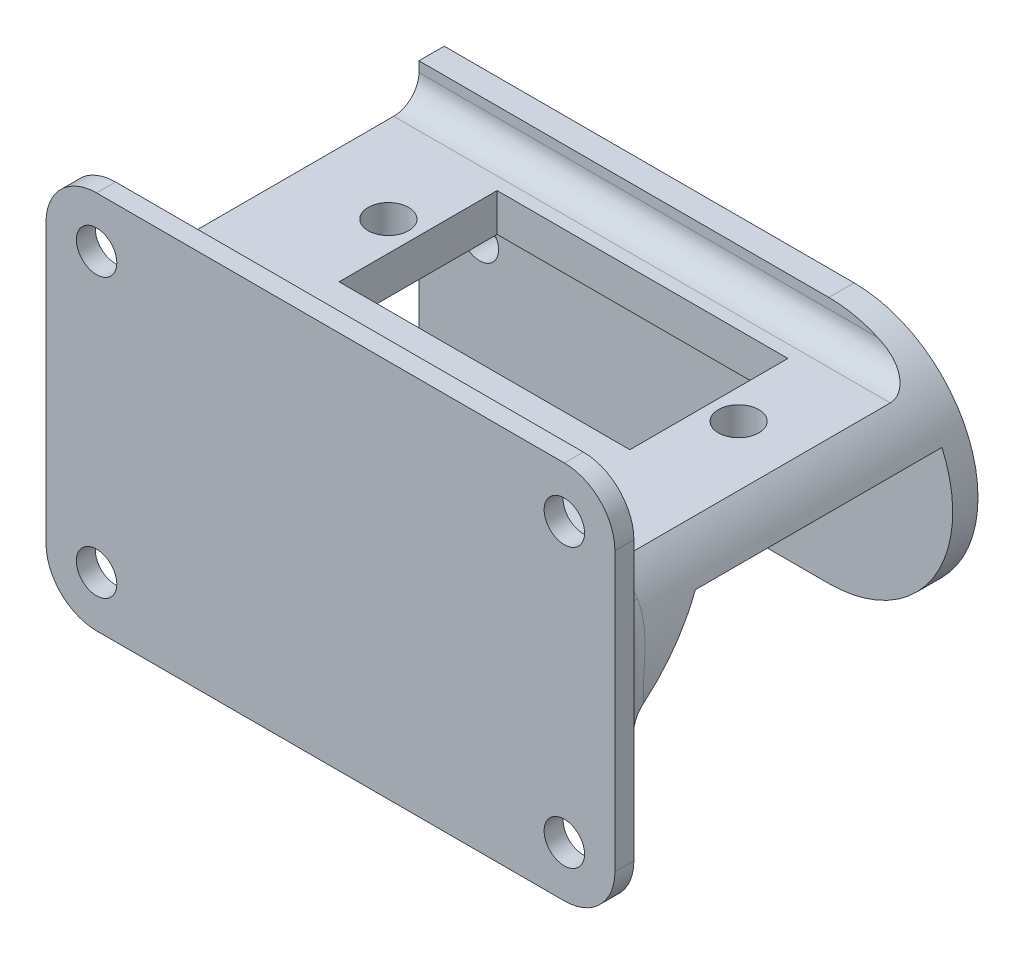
ISO-10303-21;
HEADER;
FILE_DESCRIPTION(('STEP AP214'),'2;1');
FILE_NAME('part.step','',(''),(''),'','','');
FILE_SCHEMA(('AUTOMOTIVE_DESIGN { 1 0 10303 214 1 1 1 1 }'));
ENDSEC;
DATA;
#1=APPLICATION_CONTEXT('core data for automotive mechanical design processes');
#2=APPLICATION_PROTOCOL_DEFINITION('international standard','automotive_design',2000,#1);
#3=PRODUCT_CONTEXT('',#1,'mechanical');
#4=PRODUCT('Part','Part','',(#3));
#5=PRODUCT_RELATED_PRODUCT_CATEGORY('part','',(#4));
#6=PRODUCT_DEFINITION_FORMATION('','',#4);
#7=PRODUCT_DEFINITION_CONTEXT('part definition',#1,'design');
#8=PRODUCT_DEFINITION('design','',#6,#7);
#9=PRODUCT_DEFINITION_SHAPE('','',#8);
#10=(LENGTH_UNIT() NAMED_UNIT(*) SI_UNIT(.MILLI.,.METRE.));
#11=(NAMED_UNIT(*) PLANE_ANGLE_UNIT() SI_UNIT($,.RADIAN.));
#12=(NAMED_UNIT(*) SI_UNIT($,.STERADIAN.) SOLID_ANGLE_UNIT());
#13=UNCERTAINTY_MEASURE_WITH_UNIT(LENGTH_MEASURE(1.E-05),#10,'distance_accuracy_value','');
#14=(GEOMETRIC_REPRESENTATION_CONTEXT(3) GLOBAL_UNCERTAINTY_ASSIGNED_CONTEXT((#13)) GLOBAL_UNIT_ASSIGNED_CONTEXT((#10,
#11,#12)) REPRESENTATION_CONTEXT('',''));
#15=CARTESIAN_POINT('',(0.,0.,0.));
#16=DIRECTION('',(0.,0.,1.));
#17=DIRECTION('',(1.,0.,0.));
#18=AXIS2_PLACEMENT_3D('',#15,#16,#17);
#19=CARTESIAN_POINT('',(0.,4.,74.7));
#20=DIRECTION('',(0.,-1.,0.));
#21=DIRECTION('',(1.,0.,0.));
#22=AXIS2_PLACEMENT_3D('',#19,#20,#21);
#23=PLANE('',#22);
#24=DIRECTION('',(0.,0.,-1.));
#25=VECTOR('',#24,1.);
#26=CARTESIAN_POINT('',(30.2961436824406,4.,74.7));
#27=LINE('',#26,#25);
#28=CARTESIAN_POINT('',(30.2961436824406,4.,68.7));
#29=VERTEX_POINT('',#28);
#30=CARTESIAN_POINT('',(30.2961436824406,4.,49.2));
#31=VERTEX_POINT('',#30);
#32=EDGE_CURVE('E361',#29,#31,#27,.T.);
#33=ORIENTED_EDGE('',*,*,#32,.F.);
#34=DIRECTION('',(-1.,0.,0.));
#35=VECTOR('',#34,1.);
#36=CARTESIAN_POINT('',(0.,4.,68.7));
#37=LINE('',#36,#35);
#38=CARTESIAN_POINT('',(-11.0695424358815,4.,68.7));
#39=VERTEX_POINT('',#38);
#40=EDGE_CURVE('E562',#29,#39,#37,.T.);
#41=ORIENTED_EDGE('',*,*,#40,.T.);
#42=DIRECTION('',(0.,0.,-1.));
#43=VECTOR('',#42,1.);
#44=CARTESIAN_POINT('',(-11.0695424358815,4.,74.7));
#45=LINE('',#44,#43);
#46=CARTESIAN_POINT('',(-11.0695424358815,4.,49.2));
#47=VERTEX_POINT('',#46);
#48=EDGE_CURVE('E354',#39,#47,#45,.T.);
#49=ORIENTED_EDGE('',*,*,#48,.T.);
#50=DIRECTION('',(-1.,0.,0.));
#51=VECTOR('',#50,1.);
#52=CARTESIAN_POINT('',(0.,4.,49.2));
#53=LINE('',#52,#51);
#54=CARTESIAN_POINT('',(4.61330062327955,4.,49.2));
#55=VERTEX_POINT('',#54);
#56=EDGE_CURVE('E236',#55,#47,#53,.T.);
#57=ORIENTED_EDGE('',*,*,#56,.F.);
#58=DIRECTION('',(0.,0.,-1.));
#59=VECTOR('',#58,1.);
#60=CARTESIAN_POINT('',(4.61330062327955,4.,74.7));
#61=LINE('',#60,#59);
#62=CARTESIAN_POINT('',(4.61330062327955,4.,52.2));
#63=VERTEX_POINT('',#62);
#64=EDGE_CURVE('E232',#63,#55,#61,.T.);
#65=ORIENTED_EDGE('',*,*,#64,.F.);
#66=DIRECTION('',(-1.,0.,0.));
#67=VECTOR('',#66,1.);
#68=CARTESIAN_POINT('',(21.1133006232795,3.99999999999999,52.2));
#69=LINE('',#68,#67);
#70=CARTESIAN_POINT('',(-1.88669937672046,4.,52.2));
#71=VERTEX_POINT('',#70);
#72=EDGE_CURVE('E215',#63,#71,#69,.T.);
#73=ORIENTED_EDGE('',*,*,#72,.T.);
#74=DIRECTION('',(0.,0.,1.));
#75=VECTOR('',#74,1.);
#76=CARTESIAN_POINT('',(-1.88669937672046,4.,52.2));
#77=LINE('',#76,#75);
#78=CARTESIAN_POINT('',(-1.88669937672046,4.,64.7));
#79=VERTEX_POINT('',#78);
#80=EDGE_CURVE('E335',#71,#79,#77,.T.);
#81=ORIENTED_EDGE('',*,*,#80,.T.);
#82=DIRECTION('',(1.,0.,0.));
#83=VECTOR('',#82,1.);
#84=CARTESIAN_POINT('',(21.1133006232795,3.99999999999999,64.7));
#85=LINE('',#84,#83);
#86=CARTESIAN_POINT('',(21.1133006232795,4.,64.7));
#87=VERTEX_POINT('',#86);
#88=EDGE_CURVE('E337',#79,#87,#85,.T.);
#89=ORIENTED_EDGE('',*,*,#88,.T.);
#90=DIRECTION('',(0.,0.,-1.));
#91=VECTOR('',#90,1.);
#92=CARTESIAN_POINT('',(21.1133006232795,3.99999999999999,52.2));
#93=LINE('',#92,#91);
#94=CARTESIAN_POINT('',(21.1133006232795,3.99999999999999,52.2));
#95=VERTEX_POINT('',#94);
#96=EDGE_CURVE('E227',#87,#95,#93,.T.);
#97=ORIENTED_EDGE('',*,*,#96,.T.);
#98=CARTESIAN_POINT('',(14.6133006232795,3.99999999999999,52.2));
#99=VERTEX_POINT('',#98);
#100=EDGE_CURVE('E229',#95,#99,#69,.T.);
#101=ORIENTED_EDGE('',*,*,#100,.T.);
#102=DIRECTION('',(0.,0.,-1.));
#103=VECTOR('',#102,1.);
#104=CARTESIAN_POINT('',(14.6133006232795,4.,74.7));
#105=LINE('',#104,#103);
#106=CARTESIAN_POINT('',(14.6133006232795,4.,49.2));
#107=VERTEX_POINT('',#106);
#108=EDGE_CURVE('E252',#99,#107,#105,.T.);
#109=ORIENTED_EDGE('',*,*,#108,.T.);
#110=EDGE_CURVE('E351',#31,#107,#53,.T.);
#111=ORIENTED_EDGE('',*,*,#110,.F.);
#112=EDGE_LOOP('',(#33,#41,#49,#57,#65,#73,#81,#89,#97,#101,#109,#111));
#113=FACE_BOUND('',#112,.T.);
#114=CARTESIAN_POINT('',(23.4633006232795,3.99999999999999,58.45));
#115=DIRECTION('',(0.,1.,0.));
#116=DIRECTION('',(-1.,0.,0.));
#117=AXIS2_PLACEMENT_3D('',#114,#115,#116);
#118=CIRCLE('',#117,1.6);
#119=CARTESIAN_POINT('',(21.8633006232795,3.99999999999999,58.45));
#120=VERTEX_POINT('',#119);
#121=EDGE_CURVE('E315',#120,#120,#118,.T.);
#122=ORIENTED_EDGE('',*,*,#121,.T.);
#123=EDGE_LOOP('',(#122));
#124=FACE_BOUND('',#123,.T.);
#125=CARTESIAN_POINT('',(-4.23669937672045,4.,58.45));
#126=DIRECTION('',(0.,1.,0.));
#127=DIRECTION('',(-1.,0.,0.));
#128=AXIS2_PLACEMENT_3D('',#125,#126,#127);
#129=CIRCLE('',#128,1.6);
#130=CARTESIAN_POINT('',(-5.83669937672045,4.,58.45));
#131=VERTEX_POINT('',#130);
#132=EDGE_CURVE('E302',#131,#131,#129,.T.);
#133=ORIENTED_EDGE('',*,*,#132,.T.);
#134=EDGE_LOOP('',(#133));
#135=FACE_BOUND('',#134,.T.);
#136=ADVANCED_FACE('F36',(#113,#124,#135),#23,.T.);
#137=CARTESIAN_POINT('',(0.,6.99999999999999,74.7));
#138=DIRECTION('',(0.,1.,0.));
#139=DIRECTION('',(-1.,0.,0.));
#140=AXIS2_PLACEMENT_3D('',#137,#138,#139);
#141=PLANE('',#140);
#142=DIRECTION('',(0.,0.,1.));
#143=VECTOR('',#142,1.);
#144=CARTESIAN_POINT('',(-1.88669937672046,6.99999999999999,52.2));
#145=LINE('',#144,#143);
#146=CARTESIAN_POINT('',(-1.88669937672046,6.99999999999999,52.2));
#147=VERTEX_POINT('',#146);
#148=CARTESIAN_POINT('',(-1.88669937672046,6.99999999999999,64.7));
#149=VERTEX_POINT('',#148);
#150=EDGE_CURVE('E322',#147,#149,#145,.T.);
#151=ORIENTED_EDGE('',*,*,#150,.F.);
#152=DIRECTION('',(-1.,0.,0.));
#153=VECTOR('',#152,1.);
#154=CARTESIAN_POINT('',(21.1133006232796,6.99999999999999,52.2));
#155=LINE('',#154,#153);
#156=CARTESIAN_POINT('',(21.1133006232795,6.99999999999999,52.2));
#157=VERTEX_POINT('',#156);
#158=EDGE_CURVE('E328',#157,#147,#155,.T.);
#159=ORIENTED_EDGE('',*,*,#158,.F.);
#160=DIRECTION('',(0.,0.,-1.));
#161=VECTOR('',#160,1.);
#162=CARTESIAN_POINT('',(21.1133006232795,6.99999999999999,52.2));
#163=LINE('',#162,#161);
#164=CARTESIAN_POINT('',(21.1133006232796,6.99999999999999,64.7));
#165=VERTEX_POINT('',#164);
#166=EDGE_CURVE('E330',#165,#157,#163,.T.);
#167=ORIENTED_EDGE('',*,*,#166,.F.);
#168=DIRECTION('',(1.,0.,0.));
#169=VECTOR('',#168,1.);
#170=CARTESIAN_POINT('',(21.1133006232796,6.99999999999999,64.7));
#171=LINE('',#170,#169);
#172=EDGE_CURVE('E348',#149,#165,#171,.T.);
#173=ORIENTED_EDGE('',*,*,#172,.F.);
#174=EDGE_LOOP('',(#151,#159,#167,#173));
#175=FACE_BOUND('',#174,.T.);
#176=DIRECTION('',(1.,0.,0.));
#177=VECTOR('',#176,1.);
#178=CARTESIAN_POINT('',(0.,6.99999999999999,51.2));
#179=LINE('',#178,#177);
#180=CARTESIAN_POINT('',(28.2082072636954,6.99999999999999,51.2));
#181=VERTEX_POINT('',#180);
#182=CARTESIAN_POINT('',(-11.0695424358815,6.99999999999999,51.2));
#183=VERTEX_POINT('',#182);
#184=EDGE_CURVE('E411',#181,#183,#179,.F.);
#185=ORIENTED_EDGE('',*,*,#184,.T.);
#186=DIRECTION('',(0.,0.,-1.));
#187=VECTOR('',#186,1.);
#188=CARTESIAN_POINT('',(-11.0695424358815,6.99999999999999,74.7));
#189=LINE('',#188,#187);
#190=CARTESIAN_POINT('',(-11.0695424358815,6.99999999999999,72.7));
#191=VERTEX_POINT('',#190);
#192=EDGE_CURVE('E356',#191,#183,#189,.T.);
#193=ORIENTED_EDGE('',*,*,#192,.F.);
#194=DIRECTION('',(1.,0.,0.));
#195=VECTOR('',#194,1.);
#196=CARTESIAN_POINT('',(0.,6.99999999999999,72.7));
#197=LINE('',#196,#195);
#198=CARTESIAN_POINT('',(28.2082072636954,6.99999999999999,72.7));
#199=VERTEX_POINT('',#198);
#200=EDGE_CURVE('E455',#191,#199,#197,.T.);
#201=ORIENTED_EDGE('',*,*,#200,.T.);
#202=DIRECTION('',(0.,0.,-1.));
#203=VECTOR('',#202,1.);
#204=CARTESIAN_POINT('',(28.2082072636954,6.99999999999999,74.7));
#205=LINE('',#204,#203);
#206=EDGE_CURVE('E359',#199,#181,#205,.T.);
#207=ORIENTED_EDGE('',*,*,#206,.T.);
#208=EDGE_LOOP('',(#185,#193,#201,#207));
#209=FACE_BOUND('',#208,.T.);
#210=CARTESIAN_POINT('',(23.4633006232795,6.99999999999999,58.45));
#211=DIRECTION('',(0.,1.,0.));
#212=DIRECTION('',(-1.,0.,0.));
#213=AXIS2_PLACEMENT_3D('',#210,#211,#212);
#214=CIRCLE('',#213,1.6);
#215=CARTESIAN_POINT('',(21.8633006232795,6.99999999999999,58.45));
#216=VERTEX_POINT('',#215);
#217=EDGE_CURVE('E318',#216,#216,#214,.T.);
#218=ORIENTED_EDGE('',*,*,#217,.F.);
#219=EDGE_LOOP('',(#218));
#220=FACE_BOUND('',#219,.T.);
#221=CARTESIAN_POINT('',(-4.23669937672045,6.99999999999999,58.45));
#222=DIRECTION('',(0.,1.,0.));
#223=DIRECTION('',(-1.,0.,0.));
#224=AXIS2_PLACEMENT_3D('',#221,#222,#223);
#225=CIRCLE('',#224,1.6);
#226=CARTESIAN_POINT('',(-5.83669937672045,6.99999999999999,58.45));
#227=VERTEX_POINT('',#226);
#228=EDGE_CURVE('E319',#227,#227,#225,.T.);
#229=ORIENTED_EDGE('',*,*,#228,.F.);
#230=EDGE_LOOP('',(#229));
#231=FACE_BOUND('',#230,.T.);
#232=ADVANCED_FACE('F512',(#175,#209,#220,#231),#141,.T.);
#233=CARTESIAN_POINT('',(21.3496359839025,0.,49.2));
#234=DIRECTION('',(0.,0.,-1.));
#235=DIRECTION('',(-1.,0.,0.));
#236=AXIS2_PLACEMENT_3D('',#233,#234,#235);
#237=PLANE('',#236);
#238=CARTESIAN_POINT('',(-6.26954243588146,0.,49.2));
#239=DIRECTION('',(0.,0.,1.));
#240=DIRECTION('',(1.,0.,0.));
#241=AXIS2_PLACEMENT_3D('',#238,#239,#240);
#242=CIRCLE('',#241,1.5);
#243=CARTESIAN_POINT('',(-4.76954243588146,0.,49.2));
#244=VERTEX_POINT('',#243);
#245=EDGE_CURVE('E364',#244,#244,#242,.T.);
#246=ORIENTED_EDGE('',*,*,#245,.F.);
#247=EDGE_LOOP('',(#246));
#248=FACE_BOUND('',#247,.T.);
#249=CARTESIAN_POINT('',(18.7304575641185,0.,49.2));
#250=DIRECTION('',(0.,0.,1.));
#251=DIRECTION('',(1.,0.,0.));
#252=AXIS2_PLACEMENT_3D('',#249,#250,#251);
#253=CIRCLE('',#252,1.5);
#254=CARTESIAN_POINT('',(20.2304575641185,0.,49.2));
#255=VERTEX_POINT('',#254);
#256=EDGE_CURVE('E370',#255,#255,#253,.T.);
#257=ORIENTED_EDGE('',*,*,#256,.F.);
#258=EDGE_LOOP('',(#257));
#259=FACE_BOUND('',#258,.T.);
#260=DIRECTION('',(1.,0.,0.));
#261=VECTOR('',#260,1.);
#262=CARTESIAN_POINT('',(21.3496359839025,0.999999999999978,49.2));
#263=LINE('',#262,#261);
#264=CARTESIAN_POINT('',(14.6133006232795,0.999999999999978,49.2));
#265=VERTEX_POINT('',#264);
#266=CARTESIAN_POINT('',(4.61330062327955,0.999999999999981,49.2));
#267=VERTEX_POINT('',#266);
#268=EDGE_CURVE('E260',#265,#267,#263,.F.);
#269=ORIENTED_EDGE('',*,*,#268,.T.);
#270=DIRECTION('',(0.,1.,0.));
#271=VECTOR('',#270,1.);
#272=CARTESIAN_POINT('',(4.61330062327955,0.,49.2));
#273=LINE('',#272,#271);
#274=EDGE_CURVE('E240',#267,#55,#273,.T.);
#275=ORIENTED_EDGE('',*,*,#274,.T.);
#276=ORIENTED_EDGE('',*,*,#56,.T.);
#277=DIRECTION('',(0.,-1.,0.));
#278=VECTOR('',#277,1.);
#279=CARTESIAN_POINT('',(-11.0695424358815,9.8,49.2));
#280=LINE('',#279,#278);
#281=CARTESIAN_POINT('',(-11.0695424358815,-9.8,49.2));
#282=VERTEX_POINT('',#281);
#283=EDGE_CURVE('E378',#47,#282,#280,.T.);
#284=ORIENTED_EDGE('',*,*,#283,.T.);
#285=DIRECTION('',(1.,0.,0.));
#286=VECTOR('',#285,1.);
#287=CARTESIAN_POINT('',(-11.0695424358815,-9.8,49.2));
#288=LINE('',#287,#286);
#289=CARTESIAN_POINT('',(21.3496359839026,-9.79999999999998,49.2));
#290=VERTEX_POINT('',#289);
#291=EDGE_CURVE('E383',#282,#290,#288,.T.);
#292=ORIENTED_EDGE('',*,*,#291,.T.);
#293=CARTESIAN_POINT('',(21.3496359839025,0.,49.2));
#294=DIRECTION('',(0.,0.,1.));
#295=DIRECTION('',(-1.,0.,0.));
#296=AXIS2_PLACEMENT_3D('',#293,#294,#295);
#297=CIRCLE('',#296,9.79999999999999);
#298=EDGE_CURVE('E386',#290,#31,#297,.T.);
#299=ORIENTED_EDGE('',*,*,#298,.T.);
#300=ORIENTED_EDGE('',*,*,#110,.T.);
#301=DIRECTION('',(0.,1.,0.));
#302=VECTOR('',#301,1.);
#303=CARTESIAN_POINT('',(14.6133006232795,0.,49.2));
#304=LINE('',#303,#302);
#305=EDGE_CURVE('E241',#265,#107,#304,.T.);
#306=ORIENTED_EDGE('',*,*,#305,.F.);
#307=EDGE_LOOP('',(#269,#275,#276,#284,#292,#299,#300,#306));
#308=FACE_BOUND('',#307,.T.);
#309=ADVANCED_FACE('F515',(#248,#259,#308),#237,.F.);
#310=DIRECTION('',(1.,0.,0.));
#311=VECTOR('',#310,1.);
#312=CARTESIAN_POINT('',(21.3496359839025,8.99999999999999,49.2));
#313=LINE('',#312,#311);
#314=CARTESIAN_POINT('',(-11.0695424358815,8.99999999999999,49.2));
#315=VERTEX_POINT('',#314);
#316=CARTESIAN_POINT('',(25.2277798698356,8.99999999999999,49.2));
#317=VERTEX_POINT('',#316);
#318=EDGE_CURVE('E409',#315,#317,#313,.T.);
#319=ORIENTED_EDGE('',*,*,#318,.T.);
#320=CARTESIAN_POINT('',(21.3496359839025,9.8,49.2));
#321=VERTEX_POINT('',#320);
#322=EDGE_CURVE('E385',#317,#321,#297,.T.);
#323=ORIENTED_EDGE('',*,*,#322,.T.);
#324=DIRECTION('',(-1.,0.,0.));
#325=VECTOR('',#324,1.);
#326=CARTESIAN_POINT('',(11.3496359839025,9.8,49.2));
#327=LINE('',#326,#325);
#328=CARTESIAN_POINT('',(-11.0695424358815,9.8,49.2));
#329=VERTEX_POINT('',#328);
#330=EDGE_CURVE('E376',#321,#329,#327,.T.);
#331=ORIENTED_EDGE('',*,*,#330,.T.);
#332=EDGE_CURVE('E380',#329,#315,#280,.T.);
#333=ORIENTED_EDGE('',*,*,#332,.T.);
#334=EDGE_LOOP('',(#319,#323,#331,#333));
#335=FACE_BOUND('',#334,.T.);
#336=ADVANCED_FACE('F526',(#335),#237,.F.);
#337=CARTESIAN_POINT('',(21.3496359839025,0.,47.2));
#338=DIRECTION('',(0.,0.,-1.));
#339=DIRECTION('',(-1.,0.,0.));
#340=AXIS2_PLACEMENT_3D('',#337,#338,#339);
#341=PLANE('',#340);
#342=DIRECTION('',(0.,-1.,0.));
#343=VECTOR('',#342,1.);
#344=CARTESIAN_POINT('',(-11.0695424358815,9.8,47.2));
#345=LINE('',#344,#343);
#346=CARTESIAN_POINT('',(-11.0695424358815,9.8,47.2));
#347=VERTEX_POINT('',#346);
#348=CARTESIAN_POINT('',(-11.0695424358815,-9.8,47.2));
#349=VERTEX_POINT('',#348);
#350=EDGE_CURVE('E391',#347,#349,#345,.T.);
#351=ORIENTED_EDGE('',*,*,#350,.F.);
#352=DIRECTION('',(-1.,0.,0.));
#353=VECTOR('',#352,1.);
#354=CARTESIAN_POINT('',(11.3496359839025,9.8,47.2));
#355=LINE('',#354,#353);
#356=CARTESIAN_POINT('',(21.3496359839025,9.8,47.2));
#357=VERTEX_POINT('',#356);
#358=EDGE_CURVE('E373',#357,#347,#355,.T.);
#359=ORIENTED_EDGE('',*,*,#358,.F.);
#360=CARTESIAN_POINT('',(21.3496359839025,0.,47.2));
#361=DIRECTION('',(0.,0.,1.));
#362=DIRECTION('',(-1.,0.,0.));
#363=AXIS2_PLACEMENT_3D('',#360,#361,#362);
#364=CIRCLE('',#363,9.79999999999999);
#365=CARTESIAN_POINT('',(21.3496359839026,-9.79999999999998,47.2));
#366=VERTEX_POINT('',#365);
#367=EDGE_CURVE('E379',#366,#357,#364,.T.);
#368=ORIENTED_EDGE('',*,*,#367,.F.);
#369=DIRECTION('',(1.,0.,0.));
#370=VECTOR('',#369,1.);
#371=CARTESIAN_POINT('',(11.3496358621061,-9.80000000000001,47.2));
#372=LINE('',#371,#370);
#373=EDGE_CURVE('E394',#349,#366,#372,.T.);
#374=ORIENTED_EDGE('',*,*,#373,.F.);
#375=EDGE_LOOP('',(#351,#359,#368,#374));
#376=FACE_BOUND('',#375,.T.);
#377=CARTESIAN_POINT('',(18.7304575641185,0.,47.2));
#378=DIRECTION('',(0.,0.,1.));
#379=DIRECTION('',(1.,0.,0.));
#380=AXIS2_PLACEMENT_3D('',#377,#378,#379);
#381=CIRCLE('',#380,1.5);
#382=CARTESIAN_POINT('',(20.2304575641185,0.,47.2));
#383=VERTEX_POINT('',#382);
#384=EDGE_CURVE('E367',#383,#383,#381,.T.);
#385=ORIENTED_EDGE('',*,*,#384,.T.);
#386=EDGE_LOOP('',(#385));
#387=FACE_BOUND('',#386,.T.);
#388=CARTESIAN_POINT('',(-6.26954243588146,0.,47.2));
#389=DIRECTION('',(0.,0.,1.));
#390=DIRECTION('',(1.,0.,0.));
#391=AXIS2_PLACEMENT_3D('',#388,#389,#390);
#392=CIRCLE('',#391,1.5);
#393=CARTESIAN_POINT('',(-4.76954243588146,0.,47.2));
#394=VERTEX_POINT('',#393);
#395=EDGE_CURVE('E363',#394,#394,#392,.T.);
#396=ORIENTED_EDGE('',*,*,#395,.T.);
#397=EDGE_LOOP('',(#396));
#398=FACE_BOUND('',#397,.T.);
#399=ADVANCED_FACE('F528',(#376,#387,#398),#341,.T.);
#400=CARTESIAN_POINT('',(11.3496359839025,9.8,49.2));
#401=DIRECTION('',(0.,-1.,0.));
#402=DIRECTION('',(0.,0.,-1.));
#403=AXIS2_PLACEMENT_3D('',#400,#401,#402);
#404=PLANE('',#403);
#405=DIRECTION('',(0.,0.,-1.));
#406=VECTOR('',#405,1.);
#407=CARTESIAN_POINT('',(-11.0695424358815,9.8,49.2));
#408=LINE('',#407,#406);
#409=EDGE_CURVE('E406',#329,#347,#408,.T.);
#410=ORIENTED_EDGE('',*,*,#409,.F.);
#411=ORIENTED_EDGE('',*,*,#330,.F.);
#412=DIRECTION('',(0.,0.,-1.));
#413=VECTOR('',#412,1.);
#414=CARTESIAN_POINT('',(21.3496359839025,9.8,49.2));
#415=LINE('',#414,#413);
#416=EDGE_CURVE('E389',#321,#357,#415,.T.);
#417=ORIENTED_EDGE('',*,*,#416,.T.);
#418=ORIENTED_EDGE('',*,*,#358,.T.);
#419=EDGE_LOOP('',(#410,#411,#417,#418));
#420=FACE_BOUND('',#419,.T.);
#421=ADVANCED_FACE('F435',(#420),#404,.F.);
#422=CARTESIAN_POINT('',(-11.0695424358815,9.8,49.2));
#423=DIRECTION('',(1.,0.,0.));
#424=DIRECTION('',(0.,0.,-1.));
#425=AXIS2_PLACEMENT_3D('',#422,#423,#424);
#426=PLANE('',#425);
#427=ORIENTED_EDGE('',*,*,#48,.F.);
#428=DIRECTION('',(0.,-0.707106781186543,0.707106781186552));
#429=VECTOR('',#428,1.);
#430=CARTESIAN_POINT('',(-11.0695424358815,16.6499999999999,56.0499999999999));
#431=LINE('',#430,#429);
#432=CARTESIAN_POINT('',(-11.0695424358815,0.,72.7));
#433=VERTEX_POINT('',#432);
#434=EDGE_CURVE('E558',#39,#433,#431,.T.);
#435=ORIENTED_EDGE('',*,*,#434,.T.);
#436=DIRECTION('',(0.,-1.,0.));
#437=VECTOR('',#436,1.);
#438=CARTESIAN_POINT('',(-11.0695424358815,6.99999999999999,72.7));
#439=LINE('',#438,#437);
#440=EDGE_CURVE('E453',#433,#191,#439,.F.);
#441=ORIENTED_EDGE('',*,*,#440,.T.);
#442=ORIENTED_EDGE('',*,*,#192,.T.);
#443=CARTESIAN_POINT('',(-11.0695424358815,8.99999999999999,51.2));
#444=DIRECTION('',(1.,0.,0.));
#445=DIRECTION('',(0.,0.,-1.));
#446=AXIS2_PLACEMENT_3D('',#443,#444,#445);
#447=CIRCLE('',#446,2.);
#448=EDGE_CURVE('E421',#183,#315,#447,.T.);
#449=ORIENTED_EDGE('',*,*,#448,.T.);
#450=ORIENTED_EDGE('',*,*,#332,.F.);
#451=ORIENTED_EDGE('',*,*,#409,.T.);
#452=ORIENTED_EDGE('',*,*,#350,.T.);
#453=DIRECTION('',(0.,0.,-1.));
#454=VECTOR('',#453,1.);
#455=CARTESIAN_POINT('',(-11.0695424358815,-9.8,49.2));
#456=LINE('',#455,#454);
#457=EDGE_CURVE('E403',#282,#349,#456,.T.);
#458=ORIENTED_EDGE('',*,*,#457,.F.);
#459=ORIENTED_EDGE('',*,*,#283,.F.);
#460=EDGE_LOOP('',(#427,#435,#441,#442,#449,#450,#451,#452,#458,#459));
#461=FACE_BOUND('',#460,.T.);
#462=ADVANCED_FACE('F535',(#461),#426,.F.);
#463=CARTESIAN_POINT('',(11.3496358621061,-9.80000000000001,49.2));
#464=DIRECTION('',(0.,1.,0.));
#465=DIRECTION('',(-1.,0.,0.));
#466=AXIS2_PLACEMENT_3D('',#463,#464,#465);
#467=PLANE('',#466);
#468=ORIENTED_EDGE('',*,*,#373,.T.);
#469=DIRECTION('',(0.,0.,-1.));
#470=VECTOR('',#469,1.);
#471=CARTESIAN_POINT('',(21.3496359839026,-9.79999999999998,49.2));
#472=LINE('',#471,#470);
#473=EDGE_CURVE('E400',#290,#366,#472,.T.);
#474=ORIENTED_EDGE('',*,*,#473,.F.);
#475=ORIENTED_EDGE('',*,*,#291,.F.);
#476=ORIENTED_EDGE('',*,*,#457,.T.);
#477=EDGE_LOOP('',(#468,#474,#475,#476));
#478=FACE_BOUND('',#477,.T.);
#479=ADVANCED_FACE('F553',(#478),#467,.F.);
#480=CARTESIAN_POINT('',(21.3496359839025,0.,49.2));
#481=DIRECTION('',(0.,0.,-1.));
#482=DIRECTION('',(-1.,0.,0.));
#483=AXIS2_PLACEMENT_3D('',#480,#481,#482);
#484=CYLINDRICAL_SURFACE('',#483,9.79999999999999);
#485=ORIENTED_EDGE('',*,*,#206,.F.);
#486=CARTESIAN_POINT('',(21.3496359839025,0.,72.7));
#487=DIRECTION('',(0.,0.,1.));
#488=DIRECTION('',(1.,0.,0.));
#489=AXIS2_PLACEMENT_3D('',#486,#487,#488);
#490=CIRCLE('',#489,9.79999999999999);
#491=CARTESIAN_POINT('',(29.7218437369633,5.09373510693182,72.7));
#492=VERTEX_POINT('',#491);
#493=EDGE_CURVE('E449',#199,#492,#490,.F.);
#494=ORIENTED_EDGE('',*,*,#493,.T.);
#495=CARTESIAN_POINT('',(31.4304575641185,-5.91640276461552,74.7));
#496=CARTESIAN_POINT('',(30.7435666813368,-5.51669655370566,74.6556755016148));
#497=CARTESIAN_POINT('',(30.2797333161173,-5.22629463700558,74.0776840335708));
#498=CARTESIAN_POINT('',(29.8158999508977,-4.93589272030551,73.4996925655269));
#499=CARTESIAN_POINT('',(29.8288053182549,-4.91362263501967,72.7041510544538));
#500=CARTESIAN_POINT('',(31.4304575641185,-5.81200608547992,74.7));
#501=CARTESIAN_POINT('',(30.7544198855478,-5.42671356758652,74.6355074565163));
#502=CARTESIAN_POINT('',(30.3076179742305,-5.14272906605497,74.0616545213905));
#503=CARTESIAN_POINT('',(29.8606638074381,-4.85919070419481,73.4878802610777));
#504=CARTESIAN_POINT('',(29.8790505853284,-4.82692030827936,72.7080688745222));
#505=CARTESIAN_POINT('',(31.4304575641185,-5.70678876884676,74.7));
#506=CARTESIAN_POINT('',(30.7664470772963,-5.3348465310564,74.6167662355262));
#507=CARTESIAN_POINT('',(30.3359067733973,-5.05742169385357,74.0477131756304));
#508=CARTESIAN_POINT('',(29.9052256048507,-4.7804247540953,73.4787180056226));
#509=CARTESIAN_POINT('',(29.9279105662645,-4.73953643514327,72.7146118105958));
#510=CARTESIAN_POINT('',(31.4304575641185,-5.49494546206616,74.7));
#511=CARTESIAN_POINT('',(30.7921374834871,-5.1483258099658,74.5822099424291));
#512=CARTESIAN_POINT('',(30.3927223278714,-4.88379741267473,74.02370996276));
#513=CARTESIAN_POINT('',(29.9931696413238,-4.61969186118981,73.4652696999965));
#514=CARTESIAN_POINT('',(30.0227867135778,-4.56359877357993,72.7322485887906));
#515=CARTESIAN_POINT('',(31.4304575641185,-5.38832015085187,74.7));
#516=CARTESIAN_POINT('',(30.805796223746,-5.05365608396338,74.5663735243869));
#517=CARTESIAN_POINT('',(30.4212489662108,-4.79548192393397,74.0136462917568));
#518=CARTESIAN_POINT('',(30.0365727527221,-4.53771536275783,73.4609553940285));
#519=CARTESIAN_POINT('',(30.0688041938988,-4.47504554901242,72.7433403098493));
#520=CARTESIAN_POINT('',(31.4304575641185,-5.06700922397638,74.7));
#521=CARTESIAN_POINT('',(30.8481153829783,-4.76709759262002,74.5232845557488));
#522=CARTESIAN_POINT('',(30.506245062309,-4.52701157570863,73.988844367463));
#523=CARTESIAN_POINT('',(30.1638652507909,-4.28853429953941,73.4545554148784));
#524=CARTESIAN_POINT('',(30.2023537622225,-4.20819410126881,72.7823425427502));
#525=CARTESIAN_POINT('',(31.4304575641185,-4.85042439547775,74.7));
#526=CARTESIAN_POINT('',(30.8783648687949,-4.57083948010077,74.5000660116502));
#527=CARTESIAN_POINT('',(30.5622591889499,-4.34295868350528,73.979426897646));
#528=CARTESIAN_POINT('',(30.2457412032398,-4.11651978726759,73.4588173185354));
#529=CARTESIAN_POINT('',(30.2856060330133,-4.02831856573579,72.8160036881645));
#530=CARTESIAN_POINT('',(31.4304575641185,-4.4103619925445,74.7));
#531=CARTESIAN_POINT('',(30.9396231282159,-4.16860356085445,74.4633023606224));
#532=CARTESIAN_POINT('',(30.6708126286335,-3.96447973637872,73.9720199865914));
#533=CARTESIAN_POINT('',(30.4015778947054,-3.76183064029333,73.4807651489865));
#534=CARTESIAN_POINT('',(30.4415898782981,-3.66284301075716,72.8946075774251));
#535=CARTESIAN_POINT('',(31.4304575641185,-4.18683070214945,74.7));
#536=CARTESIAN_POINT('',(30.970676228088,-3.96230689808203,74.449790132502));
#537=CARTESIAN_POINT('',(30.7232941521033,-3.76994646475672,73.9741881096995));
#538=CARTESIAN_POINT('',(30.4755935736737,-3.57886257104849,73.498544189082));
#539=CARTESIAN_POINT('',(30.5141625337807,-3.4771983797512,72.9396978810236));
#540=CARTESIAN_POINT('',(31.4304575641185,-3.73612000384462,74.7));
#541=CARTESIAN_POINT('',(31.0306779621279,-3.54388055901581,74.4309976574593));
#542=CARTESIAN_POINT('',(30.8220508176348,-3.37435441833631,73.9873745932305));
#543=CARTESIAN_POINT('',(30.6131064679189,-3.20609821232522,73.5437085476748));
#544=CARTESIAN_POINT('',(30.6475734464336,-3.10287932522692,73.0367656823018));
#545=CARTESIAN_POINT('',(31.4304575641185,-3.5089387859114,74.7));
#546=CARTESIAN_POINT('',(31.0596752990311,-3.33153208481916,74.425657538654));
#547=CARTESIAN_POINT('',(30.868322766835,-3.1732923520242,73.998397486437));
#548=CARTESIAN_POINT('',(30.6767488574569,-3.01611661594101,73.5710645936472));
#549=CARTESIAN_POINT('',(30.7084056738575,-2.91420339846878,73.0887466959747));
#550=CARTESIAN_POINT('',(31.4304575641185,-3.03100112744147,74.7));
#551=CARTESIAN_POINT('',(31.1162295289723,-2.88312584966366,74.4209238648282));
#552=CARTESIAN_POINT('',(30.9571094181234,-2.74775424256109,74.0275097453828));
#553=CARTESIAN_POINT('',(30.7977272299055,-2.61363550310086,73.6340099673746));
#554=CARTESIAN_POINT('',(30.8232686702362,-2.51727212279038,73.2000925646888));
#555=CARTESIAN_POINT('',(31.4304575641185,-2.77993001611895,74.7));
#556=CARTESIAN_POINT('',(31.1435115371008,-2.64624238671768,74.4220517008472));
#557=CARTESIAN_POINT('',(30.9989346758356,-2.52277527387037,74.0461358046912));
#558=CARTESIAN_POINT('',(30.8541993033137,-2.40028904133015,73.6701348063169));
#559=CARTESIAN_POINT('',(30.8762291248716,-2.3087554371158,73.2597045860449));
#560=CARTESIAN_POINT('',(31.4304575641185,-2.27332071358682,74.7));
#561=CARTESIAN_POINT('',(31.1920713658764,-2.16698809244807,74.4286575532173));
#562=CARTESIAN_POINT('',(31.0726034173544,-2.06679827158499,74.0860223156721));
#563=CARTESIAN_POINT('',(30.9529775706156,-1.96758600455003,73.7433008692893));
#564=CARTESIAN_POINT('',(30.9684637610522,-1.88801211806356,73.375863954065));
#565=CARTESIAN_POINT('',(31.4304575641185,-2.01778026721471,74.7));
#566=CARTESIAN_POINT('',(31.2134035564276,-1.92432424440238,74.4341235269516));
#567=CARTESIAN_POINT('',(31.1044416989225,-1.83579716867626,74.1072841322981));
#568=CARTESIAN_POINT('',(30.9954017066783,-1.74796884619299,73.7803865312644));
#569=CARTESIAN_POINT('',(31.0077308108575,-1.67578361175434,73.4324096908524));
#570=CARTESIAN_POINT('',(31.4304575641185,-1.50526505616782,74.7));
#571=CARTESIAN_POINT('',(31.248699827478,-1.43690515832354,74.4459646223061));
#572=CARTESIAN_POINT('',(31.1568341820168,-1.37117884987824,74.1468884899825));
#573=CARTESIAN_POINT('',(31.0648919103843,-1.30612631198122,73.8477535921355));
#574=CARTESIAN_POINT('',(31.0719180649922,-1.25013538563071,73.533195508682));
#575=CARTESIAN_POINT('',(31.4304575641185,-1.2483602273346,74.7));
#576=CARTESIAN_POINT('',(31.2628045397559,-1.19194660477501,74.4523303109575));
#577=CARTESIAN_POINT('',(31.1775398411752,-1.13764329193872,74.1652676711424));
#578=CARTESIAN_POINT('',(31.0922491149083,-1.08372856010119,73.8781818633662));
#579=CARTESIAN_POINT('',(31.0970310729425,-1.03677374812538,73.5775964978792));
#580=CARTESIAN_POINT('',(31.4304575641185,-0.85999701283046,74.7));
#581=CARTESIAN_POINT('',(31.2781233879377,-0.821311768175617,74.4599807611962));
#582=CARTESIAN_POINT('',(31.1999802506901,-0.784075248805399,74.1864576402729));
#583=CARTESIAN_POINT('',(31.1218315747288,-0.74693672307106,73.9129285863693));
#584=CARTESIAN_POINT('',(31.1241684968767,-0.714234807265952,73.6279326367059));
#585=CARTESIAN_POINT('',(31.4304575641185,-0.73012803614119,74.7));
#586=CARTESIAN_POINT('',(31.2822577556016,-0.697335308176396,74.4622142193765));
#587=CARTESIAN_POINT('',(31.206022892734,-0.66575402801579,74.1924559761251));
#588=CARTESIAN_POINT('',(31.129785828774,-0.634232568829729,73.9226953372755));
#589=CARTESIAN_POINT('',(31.1314576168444,-0.606377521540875,73.6419965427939));
#590=CARTESIAN_POINT('',(31.4304575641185,-0.469640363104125,74.7));
#591=CARTESIAN_POINT('',(31.2885145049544,-0.448625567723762,74.4656962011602));
#592=CARTESIAN_POINT('',(31.2151613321,-0.428321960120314,74.2017053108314));
#593=CARTESIAN_POINT('',(31.1418057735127,-0.40807770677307,73.9377121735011));
#594=CARTESIAN_POINT('',(31.1424701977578,-0.390040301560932,73.6635766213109));
#595=CARTESIAN_POINT('',(31.4304575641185,-0.339021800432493,74.7));
#596=CARTESIAN_POINT('',(31.2906392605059,-0.323852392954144,74.4669459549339));
#597=CARTESIAN_POINT('',(31.2182576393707,-0.309211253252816,74.2049567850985));
#598=CARTESIAN_POINT('',(31.1458760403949,-0.294590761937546,73.9429677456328));
#599=CARTESIAN_POINT('',(31.1461942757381,-0.28156047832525,73.6710939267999));
#600=CARTESIAN_POINT('',(31.4304575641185,-0.00852639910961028,74.7));
#601=CARTESIAN_POINT('',(31.2933983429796,-0.00817781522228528,74.4685558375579));
#602=CARTESIAN_POINT('',(31.2222814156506,-0.00778677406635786,74.2091593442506));
#603=CARTESIAN_POINT('',(31.1511633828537,-0.0074444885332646,73.9497615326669));
#604=CARTESIAN_POINT('',(31.1510350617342,-0.00708124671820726,73.6808224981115));
#605=CARTESIAN_POINT('',(31.4304575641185,0.191577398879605,74.7));
#606=CARTESIAN_POINT('',(31.2926593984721,0.183067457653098,74.4681013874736));
#607=CARTESIAN_POINT('',(31.2212063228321,0.174758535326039,74.2079954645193));
#608=CARTESIAN_POINT('',(31.1497507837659,0.166541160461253,73.9478867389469));
#609=CARTESIAN_POINT('',(31.1497438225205,0.159106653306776,73.6781505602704));
#610=CARTESIAN_POINT('',(31.4304575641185,0.590587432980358,74.7));
#611=CARTESIAN_POINT('',(31.2864047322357,0.564144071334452,74.4645051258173));
#612=CARTESIAN_POINT('',(31.2120813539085,0.538595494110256,74.1985585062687));
#613=CARTESIAN_POINT('',(31.137755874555,0.513137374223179,73.9326099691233));
#614=CARTESIAN_POINT('',(31.138760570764,0.490487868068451,73.6562524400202));
#615=CARTESIAN_POINT('',(31.4304575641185,0.789492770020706,74.7));
#616=CARTESIAN_POINT('',(31.2808809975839,0.754119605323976,74.4613587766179));
#617=CARTESIAN_POINT('',(31.2040267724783,0.719886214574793,74.1902806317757));
#618=CARTESIAN_POINT('',(31.1271581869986,0.685878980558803,73.9191885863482));
#619=CARTESIAN_POINT('',(31.1290628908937,0.6556804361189,73.6370150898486));
#620=CARTESIAN_POINT('',(31.4304575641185,1.18686397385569,74.7));
#621=CARTESIAN_POINT('',(31.2652521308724,1.13320061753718,74.453551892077));
#622=CARTESIAN_POINT('',(31.1811205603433,1.08165833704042,74.1686469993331));
#623=CARTESIAN_POINT('',(31.0969743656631,1.030347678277,73.8837286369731));
#624=CARTESIAN_POINT('',(31.1013603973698,0.985700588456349,73.5856229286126));
#625=CARTESIAN_POINT('',(31.4304575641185,1.38530226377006,74.7));
#626=CARTESIAN_POINT('',(31.2550868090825,1.32241361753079,74.4488706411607));
#627=CARTESIAN_POINT('',(31.1661969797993,1.26211022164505,74.1552377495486));
#628=CARTESIAN_POINT('',(31.0772702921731,1.202169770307,73.8615749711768));
#629=CARTESIAN_POINT('',(31.083267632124,1.1505052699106,73.5533318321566));
#630=CARTESIAN_POINT('',(31.4304575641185,1.77932595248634,74.7));
#631=CARTESIAN_POINT('',(31.2305583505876,1.69746707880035,74.4396058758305));
#632=CARTESIAN_POINT('',(31.1299202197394,1.61974528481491,74.1260894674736));
#633=CARTESIAN_POINT('',(31.0292451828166,1.54238775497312,73.8125436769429));
#634=CARTESIAN_POINT('',(31.0389881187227,1.47774528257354,73.4806611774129));
#635=CARTESIAN_POINT('',(31.4304575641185,1.97491101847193,74.7));
#636=CARTESIAN_POINT('',(31.2161769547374,1.88344120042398,74.4350190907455));
#637=CARTESIAN_POINT('',(31.1085662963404,1.7969280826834,74.1103501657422));
#638=CARTESIAN_POINT('',(31.000887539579,1.71090410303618,73.7856374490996));
#639=CARTESIAN_POINT('',(31.0128004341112,1.64018033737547,73.4402806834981));
#640=CARTESIAN_POINT('',(31.4304575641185,2.32824169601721,74.7));
#641=CARTESIAN_POINT('',(31.1866252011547,2.21853514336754,74.4281559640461));
#642=CARTESIAN_POINT('',(31.0642339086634,2.11614362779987,74.0818604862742));
#643=CARTESIAN_POINT('',(30.9417970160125,2.01408144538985,73.7355357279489));
#644=CARTESIAN_POINT('',(30.9579220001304,1.93362445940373,73.3632346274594));
#645=CARTESIAN_POINT('',(31.4304575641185,2.48643000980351,74.7));
#646=CARTESIAN_POINT('',(31.1720486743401,2.36838225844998,74.42561131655));
#647=CARTESIAN_POINT('',(31.0422486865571,2.25873501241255,74.0690846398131));
#648=CARTESIAN_POINT('',(30.9123814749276,2.14948375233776,73.7125246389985));
#649=CARTESIAN_POINT('',(30.9305417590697,2.06500119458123,73.3272191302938));
#650=CARTESIAN_POINT('',(31.4304575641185,2.80114622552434,74.7));
#651=CARTESIAN_POINT('',(31.1406877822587,2.66579363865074,74.422367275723));
#652=CARTESIAN_POINT('',(30.9944622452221,2.54159756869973,74.0448036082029));
#653=CARTESIAN_POINT('',(30.8481699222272,2.41779876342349,73.6672051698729));
#654=CARTESIAN_POINT('',(30.8704528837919,2.32637567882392,73.254352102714));
#655=CARTESIAN_POINT('',(31.4304575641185,2.9576739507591,74.7));
#656=CARTESIAN_POINT('',(31.1238889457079,2.81342737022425,74.4216724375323));
#657=CARTESIAN_POINT('',(30.9686606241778,2.68186849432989,74.0332985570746));
#658=CARTESIAN_POINT('',(30.8133417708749,2.55077288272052,73.6448872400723));
#659=CARTESIAN_POINT('',(30.8377436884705,2.45637328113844,73.2175004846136));
#660=CARTESIAN_POINT('',(31.4304575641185,3.42511904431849,74.7));
#661=CARTESIAN_POINT('',(31.0705761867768,3.2537417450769,74.4234290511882));
#662=CARTESIAN_POINT('',(30.8858732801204,3.09922995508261,74.0022642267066));
#663=CARTESIAN_POINT('',(30.7007979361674,2.94658196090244,73.5809668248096));
#664=CARTESIAN_POINT('',(30.7315538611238,2.84459039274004,73.1079980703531));
#665=CARTESIAN_POINT('',(31.4304575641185,3.73371183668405,74.7));
#666=CARTESIAN_POINT('',(31.0312449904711,3.542603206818,74.4297766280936));
#667=CARTESIAN_POINT('',(30.823529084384,3.37270024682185,73.9862333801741));
#668=CARTESIAN_POINT('',(30.61520220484,3.20518358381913,73.5426179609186));
#669=CARTESIAN_POINT('',(30.6500399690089,3.10087932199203,73.036444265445));
#670=CARTESIAN_POINT('',(31.4304575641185,4.34169591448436,74.7));
#671=CARTESIAN_POINT('',(30.9495520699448,4.10617618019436,74.4577510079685));
#672=CARTESIAN_POINT('',(30.6881482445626,3.90528352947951,73.9712072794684));
#673=CARTESIAN_POINT('',(30.4261507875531,3.70674345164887,73.4846020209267));
#674=CARTESIAN_POINT('',(30.466079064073,3.60581525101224,72.9074257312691));
#675=CARTESIAN_POINT('',(31.4304575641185,4.64114503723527,74.7));
#676=CARTESIAN_POINT('',(30.9070965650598,4.38153985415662,74.4794078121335));
#677=CARTESIAN_POINT('',(30.6152129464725,4.16450363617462,73.9720599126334));
#678=CARTESIAN_POINT('',(30.322479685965,3.95028255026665,73.4648652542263));
#679=CARTESIAN_POINT('',(30.3638271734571,3.85451028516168,72.8498399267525));
#680=CARTESIAN_POINT('',(31.4304575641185,5.08390519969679,74.7));
#681=CARTESIAN_POINT('',(30.846261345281,4.78135094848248,74.5262488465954));
#682=CARTESIAN_POINT('',(30.5016924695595,4.54069160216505,73.9911346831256));
#683=CARTESIAN_POINT('',(30.1569089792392,4.3007436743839,73.4560513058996));
#684=CARTESIAN_POINT('',(30.1944644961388,4.22222635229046,72.7813363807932));
#685=CARTESIAN_POINT('',(31.4304575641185,5.23032295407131,74.7));
#686=CARTESIAN_POINT('',(30.8263736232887,4.91298012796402,74.544357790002));
#687=CARTESIAN_POINT('',(30.4631943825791,4.66389889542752,74.0004462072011));
#688=CARTESIAN_POINT('',(30.0997719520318,4.41557688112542,73.4566130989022));
#689=CARTESIAN_POINT('',(30.1353929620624,4.34382753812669,72.7614886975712));
#690=CARTESIAN_POINT('',(31.4304575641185,5.52071482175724,74.7));
#691=CARTESIAN_POINT('',(30.7887758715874,5.1714841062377,74.5857909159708));
#692=CARTESIAN_POINT('',(30.3859230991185,4.90526330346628,74.0258284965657));
#693=CARTESIAN_POINT('',(29.9828266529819,4.63980405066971,73.4659475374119));
#694=CARTESIAN_POINT('',(30.0119743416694,4.58500044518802,72.7292782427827));
#695=CARTESIAN_POINT('',(31.4304575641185,5.66468969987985,74.7));
#696=CARTESIAN_POINT('',(30.7710672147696,5.29841096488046,74.6091594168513));
#697=CARTESIAN_POINT('',(30.3471499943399,5.02342201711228,74.0418971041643));
#698=CARTESIAN_POINT('',(29.922965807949,4.74923525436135,73.4747725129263));
#699=CARTESIAN_POINT('',(29.9476289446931,4.7045728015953,72.7169130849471));
#700=CARTESIAN_POINT('',(31.4304575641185,5.97154995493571,74.7));
#701=CARTESIAN_POINT('',(30.7370113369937,5.56559154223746,74.6652983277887));
#702=CARTESIAN_POINT('',(30.2648961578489,5.27120932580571,74.0845718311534));
#703=CARTESIAN_POINT('',(29.7924254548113,4.97790048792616,73.5040306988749));
#704=CARTESIAN_POINT('',(29.8035526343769,4.95942284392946,72.7002396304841));
#705=CARTESIAN_POINT('',(31.4304575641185,6.13395104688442,74.7));
#706=CARTESIAN_POINT('',(30.7213340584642,5.70479466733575,74.6990043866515));
#707=CARTESIAN_POINT('',(30.22160487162,5.39981968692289,74.1124156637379));
#708=CARTESIAN_POINT('',(29.7215047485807,5.09595459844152,73.5261265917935));
#709=CARTESIAN_POINT('',(29.7229752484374,5.0942983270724,72.6974569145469));
#710=CARTESIAN_POINT('',(31.4304575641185,6.454151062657,74.7));
#711=CARTESIAN_POINT('',(30.6983607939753,5.97350891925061,74.7731821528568));
#712=CARTESIAN_POINT('',(30.1395239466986,5.64680211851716,74.1789075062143));
#713=CARTESIAN_POINT('',(29.5803172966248,5.32121439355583,73.5849332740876));
#714=CARTESIAN_POINT('',(29.5552863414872,5.36022715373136,72.7075055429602));
#715=CARTESIAN_POINT('',(31.4304575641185,6.61193471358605,74.7));
#716=CARTESIAN_POINT('',(30.6911577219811,6.10300834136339,74.8137655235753));
#717=CARTESIAN_POINT('',(30.100748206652,5.76514230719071,74.2175876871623));
#718=CARTESIAN_POINT('',(29.5100026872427,5.42837711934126,73.6218451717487));
#719=CARTESIAN_POINT('',(29.468155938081,5.49126781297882,72.7203837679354));
#720=CARTESIAN_POINT('',(31.4304575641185,6.85866318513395,74.7));
#721=CARTESIAN_POINT('',(30.6899937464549,6.29892492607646,74.8820782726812));
#722=CARTESIAN_POINT('',(30.0460160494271,5.94315940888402,74.2876278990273));
#723=CARTESIAN_POINT('',(29.4019127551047,5.58779756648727,73.6933350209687));
#724=CARTESIAN_POINT('',(29.3247461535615,5.69617789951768,72.7568703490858));
#725=CARTESIAN_POINT('',(31.4304575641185,6.94990332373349,74.7));
#726=CARTESIAN_POINT('',(30.6919247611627,6.37008161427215,74.9085616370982));
#727=CARTESIAN_POINT('',(30.0271352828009,6.00737044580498,74.3157292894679));
#728=CARTESIAN_POINT('',(29.362240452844,5.64504512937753,73.7230838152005));
#729=CARTESIAN_POINT('',(29.2700637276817,5.7719536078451,72.7741280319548));
#730=CARTESIAN_POINT('',(31.4304575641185,7.12928398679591,74.7));
#731=CARTESIAN_POINT('',(30.7016163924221,6.50660851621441,74.9621111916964));
#732=CARTESIAN_POINT('',(29.9938691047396,6.12981801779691,74.375077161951));
#733=CARTESIAN_POINT('',(29.2860173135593,5.75341412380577,73.7882306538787));
#734=CARTESIAN_POINT('',(29.1593212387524,5.92093076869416,72.8168801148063));
#735=CARTESIAN_POINT('',(31.4304575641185,7.21742347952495,74.7));
#736=CARTESIAN_POINT('',(30.7094171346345,6.57195650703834,74.9891877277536));
#737=CARTESIAN_POINT('',(29.9794851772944,6.18805257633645,74.4063246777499));
#738=CARTESIAN_POINT('',(29.2494781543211,5.80450767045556,73.8236742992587));
#739=CARTESIAN_POINT('',(29.1032607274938,5.99413136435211,72.842377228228));
#740=CARTESIAN_POINT('',(31.4304575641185,7.3895003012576,74.7));
#741=CARTESIAN_POINT('',(30.7319974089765,6.69553513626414,75.0422337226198));
#742=CARTESIAN_POINT('',(29.9566086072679,6.29728270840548,74.4708289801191));
#743=CARTESIAN_POINT('',(29.1811444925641,5.89938927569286,73.8996355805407));
#744=CARTESIAN_POINT('',(28.9906407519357,6.13704262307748,72.9026871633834));
#745=CARTESIAN_POINT('',(31.4304575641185,7.47345102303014,74.7));
#746=CARTESIAN_POINT('',(30.7468013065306,6.75375670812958,75.0682054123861));
#747=CARTESIAN_POINT('',(29.9480959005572,6.34830245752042,74.5040784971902));
#748=CARTESIAN_POINT('',(29.1493575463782,5.94316458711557,73.9401773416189));
#749=CARTESIAN_POINT('',(28.9340836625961,6.20676440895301,72.9374676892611));
#750=CARTESIAN_POINT('',(31.4304575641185,7.63639032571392,74.7));
#751=CARTESIAN_POINT('',(30.7844021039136,6.86210142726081,75.116702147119));
#752=CARTESIAN_POINT('',(29.9382498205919,6.4421758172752,74.5708966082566));
#753=CARTESIAN_POINT('',(29.0920639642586,6.02256803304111,74.0253167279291));
#754=CARTESIAN_POINT('',(28.8212944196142,6.34208688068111,73.0176127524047));
#755=CARTESIAN_POINT('',(31.4304575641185,7.71538383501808,74.7));
#756=CARTESIAN_POINT('',(30.8072469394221,6.91218282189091,75.1392095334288));
#757=CARTESIAN_POINT('',(29.9369092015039,6.4850376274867,74.6044648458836));
#758=CARTESIAN_POINT('',(29.0665909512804,6.0581527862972,74.069941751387));
#759=CARTESIAN_POINT('',(28.765061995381,6.40769165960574,73.0629665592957));
#760=CARTESIAN_POINT('',(31.4304575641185,7.87127099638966,74.7));
#761=CARTESIAN_POINT('',(30.8629427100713,7.00559719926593,75.1783955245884));
#762=CARTESIAN_POINT('',(29.9426346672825,6.56366243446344,74.6709720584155));
#763=CARTESIAN_POINT('',(29.0223472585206,6.12201873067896,74.1637933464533));
#764=CARTESIAN_POINT('',(28.6512377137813,6.53715726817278,73.1683027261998));
#765=CARTESIAN_POINT('',(31.4304575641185,7.94782403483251,74.7));
#766=CARTESIAN_POINT('',(30.8963188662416,7.04832907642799,75.1946331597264));
#767=CARTESIAN_POINT('',(29.9501561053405,6.59892056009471,74.7037804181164));
#768=CARTESIAN_POINT('',(29.0040820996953,6.14971954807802,74.2131328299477));
#769=CARTESIAN_POINT('',(28.5937350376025,6.60073521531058,73.2289399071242));
#770=CARTESIAN_POINT('',(31.4304575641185,8.09198573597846,74.7));
#771=CARTESIAN_POINT('',(30.9717471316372,7.12245882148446,75.214051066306));
#772=CARTESIAN_POINT('',(29.9746531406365,6.65841638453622,74.7621436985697));
#773=CARTESIAN_POINT('',(28.977642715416,6.19458500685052,74.3104417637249));
#774=CARTESIAN_POINT('',(28.4827997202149,6.72046272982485,73.3646205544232));
#775=CARTESIAN_POINT('',(31.4304575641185,8.15960369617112,74.7));
#776=CARTESIAN_POINT('',(31.0138379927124,7.15377519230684,75.2171492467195));
#777=CARTESIAN_POINT('',(29.9916188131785,6.68266560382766,74.7877061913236));
#778=CARTESIAN_POINT('',(28.9695339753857,6.21167818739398,74.3583855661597));
#779=CARTESIAN_POINT('',(28.4293628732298,6.77662001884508,73.439648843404));
#780=CARTESIAN_POINT('',(31.4304575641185,8.27377091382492,74.7));
#781=CARTESIAN_POINT('',(31.0960907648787,7.20101934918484,75.205218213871));
#782=CARTESIAN_POINT('',(30.0297544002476,6.71755038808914,74.823074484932));
#783=CARTESIAN_POINT('',(28.9635145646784,6.23417033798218,74.4410221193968));
#784=CARTESIAN_POINT('',(28.3372706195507,6.87143686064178,73.59180833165));
#785=CARTESIAN_POINT('',(31.4304575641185,8.32196129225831,74.7));
#786=CARTESIAN_POINT('',(31.1355746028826,7.21853694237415,75.192838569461));
#787=CARTESIAN_POINT('',(30.0498656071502,6.72971312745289,74.8347079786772));
#788=CARTESIAN_POINT('',(28.9642596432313,6.24093158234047,74.4766016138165));
#789=CARTESIAN_POINT('',(28.2976078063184,6.9114593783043,73.6668124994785));
#790=CARTESIAN_POINT('',(31.4304575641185,8.40837232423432,74.7));
#791=CARTESIAN_POINT('',(31.2136997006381,7.24629918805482,75.1513591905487));
#792=CARTESIAN_POINT('',(30.092223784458,6.74760966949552,74.8458380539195));
#793=CARTESIAN_POINT('',(28.9708492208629,6.24896424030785,74.5403464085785));
#794=CARTESIAN_POINT('',(28.2254755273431,6.98322447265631,73.827091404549));
#795=CARTESIAN_POINT('',(31.4304575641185,8.44659575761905,74.7));
#796=CARTESIAN_POINT('',(31.2523024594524,7.25649831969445,75.1222015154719));
#797=CARTESIAN_POINT('',(30.1144701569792,6.75334526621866,74.8453380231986));
#798=CARTESIAN_POINT('',(28.9767140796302,6.250207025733,74.5684495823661));
#799=CARTESIAN_POINT('',(28.193004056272,7.01496935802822,73.9123632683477));
#800=CARTESIAN_POINT('',(31.4304575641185,8.49516338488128,74.7));
#801=CARTESIAN_POINT('',(31.3048235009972,7.26770519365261,75.065653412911));
#802=CARTESIAN_POINT('',(30.145781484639,6.75877419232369,74.8348462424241));
#803=CARTESIAN_POINT('',(28.9867607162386,6.24984606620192,74.6040316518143));
#804=CARTESIAN_POINT('',(28.1513305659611,7.05530518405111,74.0470377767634));
#805=CARTESIAN_POINT('',(31.4304575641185,8.50994374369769,74.7));
#806=CARTESIAN_POINT('',(31.3215149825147,7.27076311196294,75.0444976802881));
#807=CARTESIAN_POINT('',(30.1559217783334,6.76005301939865,74.8296737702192));
#808=CARTESIAN_POINT('',(28.9903436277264,6.24934421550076,74.6148391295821));
#809=CARTESIAN_POINT('',(28.1385650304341,7.06758039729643,74.0933099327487));
#810=CARTESIAN_POINT('',(31.4304575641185,8.53627245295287,74.7));
#811=CARTESIAN_POINT('',(31.3521178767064,7.27577582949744,74.9982822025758));
#812=CARTESIAN_POINT('',(30.1747410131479,6.76187155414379,74.8163050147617));
#813=CARTESIAN_POINT('',(28.9973786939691,6.24796885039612,74.634317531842));
#814=CARTESIAN_POINT('',(28.1157276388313,7.08944661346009,74.1876906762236));
#815=CARTESIAN_POINT('',(31.4304575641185,8.54782254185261,74.7));
#816=CARTESIAN_POINT('',(31.3660208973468,7.2777285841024,74.9732267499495));
#817=CARTESIAN_POINT('',(30.1834207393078,6.76241165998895,74.8081103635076));
#818=CARTESIAN_POINT('',(29.0008294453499,6.24709519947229,74.6429827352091));
#819=CARTESIAN_POINT('',(28.1056543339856,7.09903906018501,74.2357982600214));
#820=CARTESIAN_POINT('',(31.4304575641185,8.56750171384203,74.7));
#821=CARTESIAN_POINT('',(31.3902015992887,7.28081129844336,74.9198915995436));
#822=CARTESIAN_POINT('',(30.1986367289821,6.7630734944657,74.789190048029));
#823=CARTESIAN_POINT('',(29.0070811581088,6.24533601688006,74.6584771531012));
#824=CARTESIAN_POINT('',(28.0884392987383,7.11538277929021,74.3334298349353));
#825=CARTESIAN_POINT('',(31.4304575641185,8.57563263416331,74.7));
#826=CARTESIAN_POINT('',(31.4004720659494,7.28194010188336,74.8916204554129));
#827=CARTESIAN_POINT('',(30.2051741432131,6.76319544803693,74.7784657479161));
#828=CARTESIAN_POINT('',(29.0098804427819,6.24445082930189,74.6653020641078));
#829=CARTESIAN_POINT('',(28.0812959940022,7.12213557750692,74.3829530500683));
#830=CARTESIAN_POINT('',(31.4304575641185,8.58834670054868,74.7));
#831=CARTESIAN_POINT('',(31.4167287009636,7.28360879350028,74.8328509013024));
#832=CARTESIAN_POINT('',(30.2155655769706,6.76328420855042,74.7552578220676));
#833=CARTESIAN_POINT('',(29.0144063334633,6.24295965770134,74.6776556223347));
#834=CARTESIAN_POINT('',(28.0701064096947,7.13269471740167,74.482933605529));
#835=CARTESIAN_POINT('',(31.4304575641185,8.59293047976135,74.7));
#836=CARTESIAN_POINT('',(31.4227088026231,7.28414796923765,74.802363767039));
#837=CARTESIAN_POINT('',(30.2194200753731,6.76325104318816,74.7427745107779));
#838=CARTESIAN_POINT('',(29.0161313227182,6.24235416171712,74.6831808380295));
#839=CARTESIAN_POINT('',(28.0660595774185,7.13650158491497,74.5333907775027));
#840=CARTESIAN_POINT('',(31.4304575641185,8.60038485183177,74.7));
#841=CARTESIAN_POINT('',(31.4324349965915,7.28502888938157,74.7187285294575));
#842=CARTESIAN_POINT('',(30.2256824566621,6.76320069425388,74.7080117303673));
#843=CARTESIAN_POINT('',(29.0189335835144,6.24137239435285,74.6972823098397));
#844=CARTESIAN_POINT('',(28.0594790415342,7.14269250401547,74.67007057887));
#845=CARTESIAN_POINT('',(31.4304575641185,8.59984269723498,74.7));
#846=CARTESIAN_POINT('',(31.4317163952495,7.28497086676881,74.6646463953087));
#847=CARTESIAN_POINT('',(30.2252163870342,6.76321069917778,74.684961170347));
#848=CARTESIAN_POINT('',(29.0187206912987,6.24145028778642,74.7052930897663));
#849=CARTESIAN_POINT('',(28.0599587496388,7.1422422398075,74.7567440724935));
#850=CARTESIAN_POINT('',(31.4304575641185,8.58829146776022,74.7));
#851=CARTESIAN_POINT('',(31.416668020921,7.28359597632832,74.5600619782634));
#852=CARTESIAN_POINT('',(30.2155301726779,6.7632780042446,74.6417531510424));
#853=CARTESIAN_POINT('',(29.0143949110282,6.24296022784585,74.7234579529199));
#854=CARTESIAN_POINT('',(28.0701540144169,7.13264884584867,74.9285289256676));
#855=CARTESIAN_POINT('',(31.4304575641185,8.57728359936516,74.7));
#856=CARTESIAN_POINT('',(31.402359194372,7.28228103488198,74.5096241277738));
#857=CARTESIAN_POINT('',(30.2063110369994,6.76333529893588,74.6215953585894));
#858=CARTESIAN_POINT('',(29.0102880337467,6.24439018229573,74.7335985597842));
#859=CARTESIAN_POINT('',(28.0798685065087,7.12350671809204,75.0136404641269));
#860=CARTESIAN_POINT('',(31.4304575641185,8.54605751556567,74.7));
#861=CARTESIAN_POINT('',(31.3637687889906,7.27750075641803,74.4197539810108));
#862=CARTESIAN_POINT('',(30.181973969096,6.76240201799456,74.5891443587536));
#863=CARTESIAN_POINT('',(29.0002002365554,6.24730441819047,74.758564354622));
#864=CARTESIAN_POINT('',(28.1072086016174,7.09757319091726,75.1763021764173));
#865=CARTESIAN_POINT('',(31.4304575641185,8.52625198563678,74.7));
#866=CARTESIAN_POINT('',(31.3399791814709,7.2741361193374,74.3799801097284));
#867=CARTESIAN_POINT('',(30.1671242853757,6.76145601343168,74.576552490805));
#868=CARTESIAN_POINT('',(28.9943160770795,6.24878190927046,74.7731480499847));
#869=CARTESIAN_POINT('',(28.1244792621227,7.08112453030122,75.254020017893));
#870=CARTESIAN_POINT('',(31.4304575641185,8.47841395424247,74.7));
#871=CARTESIAN_POINT('',(31.2862107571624,7.26409582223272,74.3114588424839));
#872=CARTESIAN_POINT('',(30.1345424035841,6.75717100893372,74.5598456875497));
#873=CARTESIAN_POINT('',(28.9829196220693,6.25025232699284,74.8082566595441));
#874=CARTESIAN_POINT('',(28.1657622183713,7.04139463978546,75.4040508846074));
#875=CARTESIAN_POINT('',(31.4304575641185,8.45038486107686,74.7));
#876=CARTESIAN_POINT('',(31.256276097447,7.25743537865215,74.2827065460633));
#877=CARTESIAN_POINT('',(30.1168114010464,6.75383299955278,74.5557272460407));
#878=CARTESIAN_POINT('',(28.9774112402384,6.25024939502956,74.8287465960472));
#879=CARTESIAN_POINT('',(28.189771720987,7.0181162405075,75.4763661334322));
#880=CARTESIAN_POINT('',(31.4304575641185,8.38420242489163,74.7));
#881=CARTESIAN_POINT('',(31.1911725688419,7.23884714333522,74.2347040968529));
#882=CARTESIAN_POINT('',(30.0798147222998,6.74295003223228,74.5560896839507));
#883=CARTESIAN_POINT('',(28.9685323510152,6.24707535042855,74.8774753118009));
#884=CARTESIAN_POINT('',(28.245735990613,6.96315116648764,75.6208326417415));
#885=CARTESIAN_POINT('',(31.4304575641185,8.34535963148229,74.7));
#886=CARTESIAN_POINT('',(31.1558014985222,7.22651943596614,74.216516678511));
#887=CARTESIAN_POINT('',(30.0605563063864,6.73504970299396,74.5613876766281));
#888=CARTESIAN_POINT('',(28.9653929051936,6.24363018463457,74.9062129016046));
#889=CARTESIAN_POINT('',(28.2782151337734,6.93089189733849,75.6923694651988));
#890=CARTESIAN_POINT('',(31.4304575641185,8.26026103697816,74.7));
#891=CARTESIAN_POINT('',(31.0860613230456,7.19553715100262,74.1925548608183));
#892=CARTESIAN_POINT('',(30.0250074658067,6.71356516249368,74.5806783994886));
#893=CARTESIAN_POINT('',(28.9640364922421,6.23164248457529,74.9687583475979));
#894=CARTESIAN_POINT('',(28.3482001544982,6.86021679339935,75.8272543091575));
#895=CARTESIAN_POINT('',(31.4304575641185,8.2139837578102,74.7));
#896=CARTESIAN_POINT('',(31.0517103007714,7.17690205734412,74.186766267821));
#897=CARTESIAN_POINT('',(30.0087259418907,6.69996429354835,74.5946966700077));
#898=CARTESIAN_POINT('',(28.9658115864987,6.22311196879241,75.0025398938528));
#899=CARTESIAN_POINT('',(28.3857205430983,6.82178312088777,75.890577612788));
#900=CARTESIAN_POINT('',(31.4304575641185,8.12618037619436,74.7));
#901=CARTESIAN_POINT('',(30.9937976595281,7.13778962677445,74.1853952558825));
#902=CARTESIAN_POINT('',(29.9839356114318,6.67021522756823,74.6253111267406));
#903=CARTESIAN_POINT('',(28.9741173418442,6.20269225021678,75.0651735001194));
#904=CARTESIAN_POINT('',(28.4556075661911,6.74886166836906,75.995733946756));
#905=CARTESIAN_POINT('',(31.4304575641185,8.08583927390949,74.7));
#906=CARTESIAN_POINT('',(30.9695439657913,7.11865296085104,74.1878256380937));
#907=CARTESIAN_POINT('',(29.9745052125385,6.65528049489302,74.6406670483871));
#908=CARTESIAN_POINT('',(28.979498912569,6.1919777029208,75.093439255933));
#909=CARTESIAN_POINT('',(28.4872989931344,6.71535804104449,76.0392338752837));
#910=CARTESIAN_POINT('',(31.4304575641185,8.00191451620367,74.7));
#911=CARTESIAN_POINT('',(30.9239181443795,7.0763697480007,74.1975266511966));
#912=CARTESIAN_POINT('',(29.9588435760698,6.62158014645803,74.6741367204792));
#913=CARTESIAN_POINT('',(28.9938012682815,6.16686012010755,75.1506776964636));
#914=CARTESIAN_POINT('',(28.5522398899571,6.64565781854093,76.1212342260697));
#915=CARTESIAN_POINT('',(31.4304575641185,7.95832767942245,74.7));
#916=CARTESIAN_POINT('',(30.9025401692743,7.05323868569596,74.2047814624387));
#917=CARTESIAN_POINT('',(29.9526155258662,6.60281073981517,74.6922531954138));
#918=CARTESIAN_POINT('',(29.0027099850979,6.15247037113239,75.1796441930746));
#919=CARTESIAN_POINT('',(28.5854908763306,6.60945858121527,76.1597296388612));
#920=CARTESIAN_POINT('',(31.4304575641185,7.86873018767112,74.7));
#921=CARTESIAN_POINT('',(30.8631804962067,7.00333098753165,74.2228669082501));
#922=CARTESIAN_POINT('',(29.9434849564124,6.56170430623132,74.7300595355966));
#923=CARTESIAN_POINT('',(29.0238087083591,6.12016291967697,75.2371739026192));
#924=CARTESIAN_POINT('',(28.6527621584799,6.53504710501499,76.2316240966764));
#925=CARTESIAN_POINT('',(31.4304575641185,7.82273917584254,74.7));
#926=CARTESIAN_POINT('',(30.845164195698,6.97660017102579,74.2336555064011));
#927=CARTESIAN_POINT('',(29.9405588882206,6.53939385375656,74.7497371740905));
#928=CARTESIAN_POINT('',(29.0359597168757,6.10228805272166,75.2657362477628));
#929=CARTESIAN_POINT('',(28.6867752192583,6.49685117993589,76.2650577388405));
#930=CARTESIAN_POINT('',(31.4304575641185,7.7285188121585,74.7));
#931=CARTESIAN_POINT('',(30.8124079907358,6.91968605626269,74.2577968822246));
#932=CARTESIAN_POINT('',(29.9378052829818,6.4913674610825,74.7899231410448));
#933=CARTESIAN_POINT('',(29.0632080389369,6.06315062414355,75.3219627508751));
#934=CARTESIAN_POINT('',(28.7553292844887,6.41860036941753,76.3273654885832));
#935=CARTESIAN_POINT('',(31.4304575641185,7.68029459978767,74.7));
#936=CARTESIAN_POINT('',(30.7976480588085,6.88952621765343,74.2711327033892));
#937=CARTESIAN_POINT('',(29.9379709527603,6.46565911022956,74.8104295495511));
#938=CARTESIAN_POINT('',(29.0782858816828,6.04191065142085,75.3496311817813));
#939=CARTESIAN_POINT('',(28.7898689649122,6.3785497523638,76.3562494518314));
#940=CARTESIAN_POINT('',(31.4304575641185,7.63108599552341,74.7));
#941=CARTESIAN_POINT('',(30.7844863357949,6.85767030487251,74.2853055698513));
#942=CARTESIAN_POINT('',(29.9396030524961,6.43833064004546,74.8309690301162));
#943=CARTESIAN_POINT('',(29.0947197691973,6.01899097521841,75.376632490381));
#944=CARTESIAN_POINT('',(28.8245133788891,6.3376815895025,76.3830354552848));
#945=(BOUNDED_SURFACE() B_SPLINE_SURFACE(3,2,((#495,#496,#497,#498,#499),(#500,#501,#502,#503,
#504),(#505,#506,#507,#508,#509),(#510,#511,#512,#513,#514),(#515,#516,#517,#518,#519),(#520,
#521,#522,#523,#524),(#525,#526,#527,#528,#529),(#530,#531,#532,#533,#534),(#535,#536,#537,#538,
#539),(#540,#541,#542,#543,#544),(#545,#546,#547,#548,#549),(#550,#551,#552,#553,#554),(#555,
#556,#557,#558,#559),(#560,#561,#562,#563,#564),(#565,#566,#567,#568,#569),(#570,#571,#572,#573,
#574),(#575,#576,#577,#578,#579),(#580,#581,#582,#583,#584),(#585,#586,#587,#588,#589),(#590,
#591,#592,#593,#594),(#595,#596,#597,#598,#599),(#600,#601,#602,#603,#604),(#605,#606,#607,#608,
#609),(#610,#611,#612,#613,#614),(#615,#616,#617,#618,#619),(#620,#621,#622,#623,#624),(#625,
#626,#627,#628,#629),(#630,#631,#632,#633,#634),(#635,#636,#637,#638,#639),(#640,#641,#642,#643,
#644),(#645,#646,#647,#648,#649),(#650,#651,#652,#653,#654),(#655,#656,#657,#658,#659),(#660,
#661,#662,#663,#664),(#665,#666,#667,#668,#669),(#670,#671,#672,#673,#674),(#675,#676,#677,#678,
#679),(#680,#681,#682,#683,#684),(#685,#686,#687,#688,#689),(#690,#691,#692,#693,#694),(#695,
#696,#697,#698,#699),(#700,#701,#702,#703,#704),(#705,#706,#707,#708,#709),(#710,#711,#712,#713,
#714),(#715,#716,#717,#718,#719),(#720,#721,#722,#723,#724),(#725,#726,#727,#728,#729),(#730,
#731,#732,#733,#734),(#735,#736,#737,#738,#739),(#740,#741,#742,#743,#744),(#745,#746,#747,#748,
#749),(#750,#751,#752,#753,#754),(#755,#756,#757,#758,#759),(#760,#761,#762,#763,#764),(#765,
#766,#767,#768,#769),(#770,#771,#772,#773,#774),(#775,#776,#777,#778,#779),(#780,#781,#782,#783,
#784),(#785,#786,#787,#788,#789),(#790,#791,#792,#793,#794),(#795,#796,#797,#798,#799),(#800,
#801,#802,#803,#804),(#805,#806,#807,#808,#809),(#810,#811,#812,#813,#814),(#815,#816,#817,#818,
#819),(#820,#821,#822,#823,#824),(#825,#826,#827,#828,#829),(#830,#831,#832,#833,#834),(#835,
#836,#837,#838,#839),(#840,#841,#842,#843,#844),(#845,#846,#847,#848,#849),(#850,#851,#852,#853,
#854),(#855,#856,#857,#858,#859),(#860,#861,#862,#863,#864),(#865,#866,#867,#868,#869),(#870,
#871,#872,#873,#874),(#875,#876,#877,#878,#879),(#880,#881,#882,#883,#884),(#885,#886,#887,#888,
#889),(#890,#891,#892,#893,#894),(#895,#896,#897,#898,#899),(#900,#901,#902,#903,#904),(#905,
#906,#907,#908,#909),(#910,#911,#912,#913,#914),(#915,#916,#917,#918,#919),(#920,#921,#922,#923,
#924),(#925,#926,#927,#928,#929),(#930,#931,#932,#933,#934),(#935,#936,#937,#938,#939),(#940,
#941,#942,#943,#944)),.UNSPECIFIED.,.F.,.F.,.F.) B_SPLINE_SURFACE_WITH_KNOTS((4,2,2,2,2,2,2,2,2,
2,2,2,2,2,2,2,2,2,2,2,2,2,2,2,2,2,2,2,2,2,2,2,2,2,2,2,2,2,2,2,2,2,2,2,4),(3,2,3),(0.,
0.362062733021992,0.723956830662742,1.44614072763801,2.17817112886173,2.91057649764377,
3.70746286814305,4.50476365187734,5.29092364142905,5.68348746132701,6.07598332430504,
6.67529919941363,7.27501942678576,7.88116965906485,8.4873900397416,8.98390887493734,
9.48048002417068,10.4742053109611,11.4589816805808,11.9506833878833,12.4422282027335,
13.0091215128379,13.5777159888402,13.9189239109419,14.2602443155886,14.600392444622,
14.940196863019,15.2982506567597,15.6559288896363,15.9581877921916,16.260362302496,
16.4130101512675,16.5655756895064,16.7180591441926,16.8705153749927,17.1290795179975,
17.3876138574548,17.6351257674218,17.8825352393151,18.1524714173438,18.4232019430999,
18.6345378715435,18.8460837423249,19.0561111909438,19.2656772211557),(0.,0.5,1.),
.UNSPECIFIED.) GEOMETRIC_REPRESENTATION_ITEM() RATIONAL_B_SPLINE_SURFACE(((1.,0.929122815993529,
1.,0.929122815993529,1.),(1.,0.93157654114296,1.,0.93157654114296,1.),(1.,0.93394995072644,1.,
0.93394995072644,1.),(1.,0.938537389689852,1.,0.938537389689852,1.),(1.,0.94075149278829,1.,
0.94075149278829,1.),(1.,0.947150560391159,1.,0.947150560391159,1.),(1.,0.951103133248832,1.,
0.951103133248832,1.),(1.,0.958460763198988,1.,0.958460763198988,1.),(1.,0.96185762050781,1.,
0.96185762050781,1.),(1.,0.968069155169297,1.,0.968069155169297,1.),(1.,0.970883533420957,1.,
0.970883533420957,1.),(1.,0.976175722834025,1.,0.976175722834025,1.),(1.,0.978602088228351,1.,
0.978602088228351,1.),(1.,0.982814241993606,1.,0.982814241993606,1.),(1.,0.984599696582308,1.,
0.984599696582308,1.),(1.,0.987512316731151,1.,0.987512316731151,1.),(1.,0.988648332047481,1.,
0.988648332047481,1.),(1.,0.989874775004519,1.,0.989874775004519,1.),(1.,0.990203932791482,1.,
0.990203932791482,1.),(1.,0.990701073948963,1.,0.990701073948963,1.),(1.,0.990869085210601,1.,
0.990869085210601,1.),(1.,0.99108749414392,1.,0.99108749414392,1.),(1.,0.991029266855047,1.,
0.991029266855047,1.),(1.,0.990533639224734,1.,0.990533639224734,1.),(1.,0.990095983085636,1.,
0.990095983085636,1.),(1.,0.988843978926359,1.,0.988843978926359,1.),(1.,0.988025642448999,1.,
0.988025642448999,1.),(1.,0.986018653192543,1.,0.986018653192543,1.),(1.,0.984829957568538,1.,
0.984829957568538,1.),(1.,0.98233200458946,1.,0.98233200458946,1.),(1.,0.981083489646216,1.,
0.981083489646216,1.),(1.,0.978336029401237,1.,0.978336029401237,1.),(1.,0.97683705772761,1.,
0.97683705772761,1.),(1.,0.971955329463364,1.,0.971955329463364,1.),(1.,0.968189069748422,1.,
0.968189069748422,1.),(1.,0.959612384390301,1.,0.959612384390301,1.),(1.,0.954811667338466,1.,
0.954811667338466,1.),(1.,0.946767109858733,1.,0.946767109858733,1.),(1.,0.94394727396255,1.,
0.94394727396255,1.),(1.,0.938018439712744,1.,0.938018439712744,1.),(1.,0.934909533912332,1.,
0.934909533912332,1.),(1.,0.927898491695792,1.,0.927898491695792,1.),(1.,0.923947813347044,1.,
0.923947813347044,1.),(1.,0.915646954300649,1.,0.915646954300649,1.),(1.,0.911295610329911,1.,
0.911295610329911,1.),(1.,0.904053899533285,1.,0.904053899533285,1.),(1.,0.901275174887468,1.,
0.901275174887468,1.),(1.,0.895607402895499,1.,0.895607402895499,1.),(1.,0.892718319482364,1.,
0.892718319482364,1.),(1.,0.886869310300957,1.,0.886869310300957,1.),(1.,0.883909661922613,1.,
0.883909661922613,1.),(1.,0.877958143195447,1.,0.877958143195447,1.),(1.,0.874966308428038,1.,
0.874966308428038,1.),(1.,0.868856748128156,1.,0.868856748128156,1.),(1.,0.865740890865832,1.,
0.865740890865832,1.),(1.,0.859671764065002,1.,0.859671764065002,1.),(1.,0.856718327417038,1.,
0.856718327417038,1.),(1.,0.851581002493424,1.,0.851581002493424,1.),(1.,0.849348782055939,1.,
0.849348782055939,1.),(1.,0.845260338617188,1.,0.845260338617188,1.),(1.,0.843404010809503,1.,
0.843404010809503,1.),(1.,0.841008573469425,1.,0.841008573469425,1.),(1.,0.840272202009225,1.,
0.840272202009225,1.),(1.,0.838951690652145,1.,0.838951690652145,1.),(1.,0.838367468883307,1.,
0.838367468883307,1.),(1.,0.837367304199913,1.,0.837367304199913,1.),(1.,0.836951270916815,1.,
0.836951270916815,1.),(1.,0.836298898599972,1.,0.836298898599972,1.),(1.,0.836062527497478,1.,
0.836062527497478,1.),(1.,0.835678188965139,1.,0.835678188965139,1.),(1.,0.835706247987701,1.,
0.835706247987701,1.),(1.,0.836301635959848,1.,0.836301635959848,1.),(1.,0.836868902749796,1.,
0.836868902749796,1.),(1.,0.838458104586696,1.,0.838458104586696,1.),(1.,0.839459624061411,1.,
0.839459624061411,1.),(1.,0.84183998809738,1.,0.84183998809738,1.),(1.,0.843218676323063,1.,
0.843218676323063,1.),(1.,0.846411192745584,1.,0.846411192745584,1.),(1.,0.848253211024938,1.,
0.848253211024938,1.),(1.,0.85219175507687,1.,0.85219175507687,1.),(1.,0.854289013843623,1.,
0.854289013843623,1.),(1.,0.858165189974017,1.,0.858165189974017,1.),(1.,0.859913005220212,1.,
0.859913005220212,1.),(1.,0.863473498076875,1.,0.863473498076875,1.),(1.,0.865286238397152,1.,
0.865286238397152,1.),(1.,0.868932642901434,1.,0.868932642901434,1.),(1.,0.870766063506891,1.,
0.870766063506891,1.),(1.,0.874441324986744,1.,0.874441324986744,1.),(1.,0.876283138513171,1.,
0.876283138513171,1.),(1.,0.878120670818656,1.,0.878120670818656,1.))) REPRESENTATION_ITEM('') SURFACE());
#946=CARTESIAN_POINT('',(28.8245133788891,6.3376815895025,76.3830354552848));
#947=CARTESIAN_POINT('',(28.7898689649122,6.3785497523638,76.3562494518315));
#948=CARTESIAN_POINT('',(28.7553292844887,6.41860036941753,76.3273654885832));
#949=CARTESIAN_POINT('',(28.6867752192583,6.49685117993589,76.2650577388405));
#950=CARTESIAN_POINT('',(28.6527621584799,6.53504710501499,76.2316240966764));
#951=CARTESIAN_POINT('',(28.5854908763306,6.60945858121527,76.1597296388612));
#952=CARTESIAN_POINT('',(28.5522398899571,6.64565781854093,76.1212342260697));
#953=CARTESIAN_POINT('',(28.4872989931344,6.71535804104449,76.0392338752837));
#954=CARTESIAN_POINT('',(28.4556075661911,6.74886166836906,75.995733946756));
#955=CARTESIAN_POINT('',(28.3857205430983,6.82178312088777,75.890577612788));
#956=CARTESIAN_POINT('',(28.3482001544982,6.86021679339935,75.8272543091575));
#957=CARTESIAN_POINT('',(28.2782151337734,6.93089189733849,75.6923694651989));
#958=CARTESIAN_POINT('',(28.245735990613,6.96315116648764,75.6208326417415));
#959=CARTESIAN_POINT('',(28.189771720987,7.0181162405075,75.4763661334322));
#960=CARTESIAN_POINT('',(28.1657622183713,7.04139463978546,75.4040508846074));
#961=CARTESIAN_POINT('',(28.1244792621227,7.08112453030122,75.254020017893));
#962=CARTESIAN_POINT('',(28.1072086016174,7.09757319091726,75.1763021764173));
#963=CARTESIAN_POINT('',(28.0798685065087,7.12350671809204,75.0136404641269));
#964=CARTESIAN_POINT('',(28.0701540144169,7.13264884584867,74.9285289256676));
#965=CARTESIAN_POINT('',(28.0599587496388,7.1422422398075,74.7567440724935));
#966=CARTESIAN_POINT('',(28.0594790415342,7.14269250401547,74.67007057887));
#967=CARTESIAN_POINT('',(28.0660595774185,7.13650158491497,74.5333907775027));
#968=CARTESIAN_POINT('',(28.0701064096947,7.13269471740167,74.482933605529));
#969=CARTESIAN_POINT('',(28.0812959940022,7.12213557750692,74.3829530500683));
#970=CARTESIAN_POINT('',(28.0884392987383,7.11538277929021,74.3334298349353));
#971=CARTESIAN_POINT('',(28.1056543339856,7.09903906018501,74.2357982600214));
#972=CARTESIAN_POINT('',(28.1157276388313,7.08944661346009,74.1876906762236));
#973=CARTESIAN_POINT('',(28.1385650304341,7.06758039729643,74.0933099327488));
#974=CARTESIAN_POINT('',(28.1513305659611,7.05530518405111,74.0470377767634));
#975=CARTESIAN_POINT('',(28.193004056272,7.01496935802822,73.9123632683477));
#976=CARTESIAN_POINT('',(28.2254755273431,6.98322447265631,73.827091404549));
#977=CARTESIAN_POINT('',(28.2976078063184,6.9114593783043,73.6668124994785));
#978=CARTESIAN_POINT('',(28.3372706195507,6.87143686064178,73.59180833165));
#979=CARTESIAN_POINT('',(28.4293628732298,6.77662001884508,73.439648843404));
#980=CARTESIAN_POINT('',(28.4827997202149,6.72046272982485,73.3646205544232));
#981=CARTESIAN_POINT('',(28.5937350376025,6.60073521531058,73.2289399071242));
#982=CARTESIAN_POINT('',(28.6512377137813,6.53715726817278,73.1683027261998));
#983=CARTESIAN_POINT('',(28.765061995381,6.40769165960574,73.0629665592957));
#984=CARTESIAN_POINT('',(28.8212944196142,6.34208688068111,73.0176127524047));
#985=CARTESIAN_POINT('',(28.9340836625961,6.20676440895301,72.9374676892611));
#986=CARTESIAN_POINT('',(28.9906407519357,6.13704262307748,72.9026871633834));
#987=CARTESIAN_POINT('',(29.1032607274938,5.99413136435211,72.842377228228));
#988=CARTESIAN_POINT('',(29.1593212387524,5.92093076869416,72.8168801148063));
#989=CARTESIAN_POINT('',(29.2700637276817,5.7719536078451,72.7741280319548));
#990=CARTESIAN_POINT('',(29.3247461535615,5.69617789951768,72.7568703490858));
#991=CARTESIAN_POINT('',(29.468155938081,5.49126781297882,72.7203837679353));
#992=CARTESIAN_POINT('',(29.5552863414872,5.36022715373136,72.7075055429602));
#993=CARTESIAN_POINT('',(29.7229752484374,5.0942983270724,72.6974569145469));
#994=CARTESIAN_POINT('',(29.8035526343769,4.95942284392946,72.7002396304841));
#995=CARTESIAN_POINT('',(29.9476289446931,4.7045728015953,72.7169130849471));
#996=CARTESIAN_POINT('',(30.0119743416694,4.58500044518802,72.7292782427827));
#997=CARTESIAN_POINT('',(30.1353929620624,4.34382753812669,72.7614886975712));
#998=CARTESIAN_POINT('',(30.1944644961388,4.22222635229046,72.7813363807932));
#999=CARTESIAN_POINT('',(30.3638271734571,3.85451028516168,72.8498399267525));
#1000=CARTESIAN_POINT('',(30.466079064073,3.60581525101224,72.9074257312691));
#1001=CARTESIAN_POINT('',(30.6500399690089,3.10087932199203,73.036444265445));
#1002=CARTESIAN_POINT('',(30.7315538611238,2.84459039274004,73.1079980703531));
#1003=CARTESIAN_POINT('',(30.8377436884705,2.45637328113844,73.2175004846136));
#1004=CARTESIAN_POINT('',(30.8704528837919,2.32637567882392,73.2543521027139));
#1005=CARTESIAN_POINT('',(30.9305417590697,2.06500119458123,73.3272191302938));
#1006=CARTESIAN_POINT('',(30.9579220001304,1.93362445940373,73.3632346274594));
#1007=CARTESIAN_POINT('',(31.0128004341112,1.64018033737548,73.4402806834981));
#1008=CARTESIAN_POINT('',(31.0389881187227,1.47774528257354,73.4806611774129));
#1009=CARTESIAN_POINT('',(31.083267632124,1.15050526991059,73.5533318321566));
#1010=CARTESIAN_POINT('',(31.1013603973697,0.985700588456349,73.5856229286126));
#1011=CARTESIAN_POINT('',(31.1290628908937,0.6556804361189,73.6370150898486));
#1012=CARTESIAN_POINT('',(31.138760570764,0.490487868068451,73.6562524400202));
#1013=CARTESIAN_POINT('',(31.1497438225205,0.159106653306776,73.6781505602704));
#1014=CARTESIAN_POINT('',(31.1510350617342,-0.00708124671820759,73.6808224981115));
#1015=CARTESIAN_POINT('',(31.1461942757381,-0.28156047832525,73.6710939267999));
#1016=CARTESIAN_POINT('',(31.1424701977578,-0.390040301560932,73.6635766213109));
#1017=CARTESIAN_POINT('',(31.1314576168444,-0.606377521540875,73.6419965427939));
#1018=CARTESIAN_POINT('',(31.1241684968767,-0.714234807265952,73.6279326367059));
#1019=CARTESIAN_POINT('',(31.0970310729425,-1.03677374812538,73.5775964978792));
#1020=CARTESIAN_POINT('',(31.0719180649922,-1.25013538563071,73.5331955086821));
#1021=CARTESIAN_POINT('',(31.0077308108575,-1.67578361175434,73.4324096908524));
#1022=CARTESIAN_POINT('',(30.9684637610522,-1.88801211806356,73.3758639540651));
#1023=CARTESIAN_POINT('',(30.8762291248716,-2.3087554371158,73.2597045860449));
#1024=CARTESIAN_POINT('',(30.8232686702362,-2.51727212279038,73.2000925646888));
#1025=CARTESIAN_POINT('',(30.7084056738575,-2.91420339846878,73.0887466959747));
#1026=CARTESIAN_POINT('',(30.6475734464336,-3.10287932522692,73.0367656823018));
#1027=CARTESIAN_POINT('',(30.5141625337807,-3.4771983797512,72.9396978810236));
#1028=CARTESIAN_POINT('',(30.4415898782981,-3.66284301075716,72.8946075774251));
#1029=CARTESIAN_POINT('',(30.2856060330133,-4.02831856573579,72.8160036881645));
#1030=CARTESIAN_POINT('',(30.2023537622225,-4.20819410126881,72.7823425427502));
#1031=CARTESIAN_POINT('',(30.0688041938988,-4.47504554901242,72.7433403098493));
#1032=CARTESIAN_POINT('',(30.0227867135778,-4.56359877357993,72.7322485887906));
#1033=CARTESIAN_POINT('',(29.9279105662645,-4.73953643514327,72.7146118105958));
#1034=CARTESIAN_POINT('',(29.8790505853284,-4.82692030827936,72.7080688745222));
#1035=CARTESIAN_POINT('',(29.8288053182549,-4.91362263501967,72.7041510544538));
#1036=B_SPLINE_CURVE_WITH_KNOTS('',3,(#946,#947,#948,#949,#950,#951,#952,#953,#954,#955,#956,
#957,#958,#959,#960,#961,#962,#963,#964,#965,#966,#967,#968,#969,#970,#971,#972,#973,#974,#975,
#976,#977,#978,#979,#980,#981,#982,#983,#984,#985,#986,#987,#988,#989,#990,#991,#992,#993,#994,
#995,#996,#997,#998,#999,#1000,#1001,#1002,#1003,#1004,#1005,#1006,#1007,#1008,#1009,#1010,
#1011,#1012,#1013,#1014,#1015,#1016,#1017,#1018,#1019,#1020,#1021,#1022,#1023,#1024,#1025,#1026,
#1027,#1028,#1029,#1030,#1031,#1032,#1033,#1034,#1035),.UNSPECIFIED.,.F.,.F.,(4,2,2,2,2,2,2,2,2,
2,2,2,2,2,2,2,2,2,2,2,2,2,2,2,2,2,2,2,2,2,2,2,2,2,2,2,2,2,2,2,2,2,2,2,4),(0.,0.209566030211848,
0.419593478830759,0.631139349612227,0.842475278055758,1.11320580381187,1.38314198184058,
1.63055145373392,1.87806336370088,2.13659770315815,2.39516184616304,2.54761807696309,
2.7001015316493,2.85266706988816,3.0053149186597,3.30748942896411,3.6097483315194,
3.96742656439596,4.32548035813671,4.66528477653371,5.00543290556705,5.34675331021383,
5.68796123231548,6.25655570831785,6.82344901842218,7.31499383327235,7.80669554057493,
8.79147191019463,9.78519719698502,10.2817683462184,10.7782871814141,11.3845075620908,
11.9906577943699,12.5903780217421,13.1896938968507,13.5821897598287,13.9747535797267,
14.7609135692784,15.5582143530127,16.3551007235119,17.087506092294,17.8195364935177,
18.541720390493,18.9036144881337,19.2656772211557),.UNSPECIFIED.);
#1037=CARTESIAN_POINT('',(31.1083436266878,-0.898679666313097,73.5986796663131));
#1038=VERTEX_POINT('',#1037);
#1039=EDGE_CURVE('E52',#492,#1038,#1036,.T.);
#1040=ORIENTED_EDGE('',*,*,#1039,.T.);
#1041=CARTESIAN_POINT('',(21.3496359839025,0.,72.7));
#1042=DIRECTION('',(0.,0.707106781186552,0.707106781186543));
#1043=DIRECTION('',(0.,0.707106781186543,-0.707106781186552));
#1044=AXIS2_PLACEMENT_3D('',#1041,#1042,#1043);
#1045=ELLIPSE('',#1044,13.8592929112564,9.79999999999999);
#1046=EDGE_CURVE('E11',#1038,#29,#1045,.T.);
#1047=ORIENTED_EDGE('',*,*,#1046,.T.);
#1048=ORIENTED_EDGE('',*,*,#32,.T.);
#1049=ORIENTED_EDGE('',*,*,#298,.F.);
#1050=ORIENTED_EDGE('',*,*,#473,.T.);
#1051=ORIENTED_EDGE('',*,*,#367,.T.);
#1052=ORIENTED_EDGE('',*,*,#416,.F.);
#1053=ORIENTED_EDGE('',*,*,#322,.F.);
#1054=CARTESIAN_POINT('',(25.2277798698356,8.99999999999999,49.2));
#1055=CARTESIAN_POINT('',(25.3048340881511,8.96679698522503,49.2000037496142));
#1056=CARTESIAN_POINT('',(25.3814579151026,8.93260563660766,49.2008265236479));
#1057=CARTESIAN_POINT('',(25.5337899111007,8.8622739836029,49.2044362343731));
#1058=CARTESIAN_POINT('',(25.6094977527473,8.82613300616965,49.2072238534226));
#1059=CARTESIAN_POINT('',(25.8360265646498,8.71439847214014,49.2190720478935));
#1060=CARTESIAN_POINT('',(25.9852855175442,8.6359100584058,49.2316262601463));
#1061=CARTESIAN_POINT('',(26.280731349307,8.47073775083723,49.2694092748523));
#1062=CARTESIAN_POINT('',(26.426832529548,8.38394403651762,49.294835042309));
#1063=CARTESIAN_POINT('',(26.7113075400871,8.20490865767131,49.3623500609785));
#1064=CARTESIAN_POINT('',(26.8497040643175,8.11268484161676,49.4043870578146));
#1065=CARTESIAN_POINT('',(27.0326189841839,7.98419875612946,49.4767055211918));
#1066=CARTESIAN_POINT('',(27.0816177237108,7.94908464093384,49.497845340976));
#1067=CARTESIAN_POINT('',(27.1779805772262,7.87870279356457,49.5433613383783));
#1068=CARTESIAN_POINT('',(27.225344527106,7.84343504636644,49.5677378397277));
#1069=CARTESIAN_POINT('',(27.3644248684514,7.73794422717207,49.6460134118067));
#1070=CARTESIAN_POINT('',(27.453400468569,7.66784242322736,49.7051617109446));
#1071=CARTESIAN_POINT('',(27.6225484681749,7.53011365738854,49.8402715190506));
#1072=CARTESIAN_POINT('',(27.7025975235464,7.46252835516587,49.9164331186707));
#1073=CARTESIAN_POINT('',(27.8491267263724,7.33525764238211,50.0865216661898));
#1074=CARTESIAN_POINT('',(27.9156339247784,7.27555656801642,50.1804124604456));
#1075=CARTESIAN_POINT('',(28.0126208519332,7.18662132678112,50.3527342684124));
#1076=CARTESIAN_POINT('',(28.047836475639,7.15373034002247,50.4266197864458));
#1077=CARTESIAN_POINT('',(28.1085992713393,7.09634836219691,50.581227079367));
#1078=CARTESIAN_POINT('',(28.1341648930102,7.07184135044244,50.6619354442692));
#1079=CARTESIAN_POINT('',(28.1719713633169,7.03536437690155,50.8181380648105));
#1080=CARTESIAN_POINT('',(28.1854657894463,7.02222181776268,50.893049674));
#1081=CARTESIAN_POINT('',(28.1990611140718,7.00895223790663,51.0070989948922));
#1082=CARTESIAN_POINT('',(28.2024853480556,7.0056028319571,51.0455070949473));
#1083=CARTESIAN_POINT('',(28.2070599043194,7.00112435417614,51.1226044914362));
#1084=CARTESIAN_POINT('',(28.2082091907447,6.99999629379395,51.1612939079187));
#1085=CARTESIAN_POINT('',(28.2082072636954,6.99999999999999,51.2));
#1086=B_SPLINE_CURVE_WITH_KNOTS('',3,(#1054,#1055,#1056,#1057,#1058,#1059,#1060,#1061,#1062,
#1063,#1064,#1065,#1066,#1067,#1068,#1069,#1070,#1071,#1072,#1073,#1074,#1075,#1076,#1077,#1078,
#1079,#1080,#1081,#1082,#1083,#1084,#1085),.UNSPECIFIED.,.F.,.F.,(4,2,2,2,2,2,2,2,2,2,2,2,2,2,2,
4),(0.,0.251687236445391,0.503461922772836,1.01016393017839,1.52486524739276,2.03796018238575,
2.22951499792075,2.42108898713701,2.80320219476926,3.19007107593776,3.57615940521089,
3.83975918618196,4.10285241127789,4.33353230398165,4.4495321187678,4.56558473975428),.UNSPECIFIED.);
#1087=EDGE_CURVE('E413',#317,#181,#1086,.T.);
#1088=ORIENTED_EDGE('',*,*,#1087,.T.);
#1089=EDGE_LOOP('',(#485,#494,#1040,#1047,#1048,#1049,#1050,#1051,#1052,#1053,#1088));
#1090=FACE_BOUND('',#1089,.T.);
#1091=ADVANCED_FACE('F423',(#1090),#484,.T.);
#1092=CARTESIAN_POINT('',(18.7304575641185,0.,49.2));
#1093=DIRECTION('',(0.,0.,-1.));
#1094=DIRECTION('',(-1.,0.,0.));
#1095=AXIS2_PLACEMENT_3D('',#1092,#1093,#1094);
#1096=CYLINDRICAL_SURFACE('',#1095,1.5);
#1097=ORIENTED_EDGE('',*,*,#256,.T.);
#1098=EDGE_LOOP('',(#1097));
#1099=FACE_BOUND('',#1098,.T.);
#1100=ORIENTED_EDGE('',*,*,#384,.F.);
#1101=EDGE_LOOP('',(#1100));
#1102=FACE_BOUND('',#1101,.T.);
#1103=ADVANCED_FACE('F521',(#1099,#1102),#1096,.F.);
#1104=CARTESIAN_POINT('',(-6.26954243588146,0.,49.2));
#1105=DIRECTION('',(0.,0.,-1.));
#1106=DIRECTION('',(-1.,0.,0.));
#1107=AXIS2_PLACEMENT_3D('',#1104,#1105,#1106);
#1108=CYLINDRICAL_SURFACE('',#1107,1.5);
#1109=ORIENTED_EDGE('',*,*,#245,.T.);
#1110=EDGE_LOOP('',(#1109));
#1111=FACE_BOUND('',#1110,.T.);
#1112=ORIENTED_EDGE('',*,*,#395,.F.);
#1113=EDGE_LOOP('',(#1112));
#1114=FACE_BOUND('',#1113,.T.);
#1115=ADVANCED_FACE('F510',(#1111,#1114),#1108,.F.);
#1116=CARTESIAN_POINT('',(21.1133006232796,49.2283731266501,52.2));
#1117=DIRECTION('',(-1.,0.,0.));
#1118=DIRECTION('',(0.,-1.,0.));
#1119=AXIS2_PLACEMENT_3D('',#1116,#1117,#1118);
#1120=PLANE('',#1119);
#1121=ORIENTED_EDGE('',*,*,#166,.T.);
#1122=DIRECTION('',(0.,-1.,0.));
#1123=VECTOR('',#1122,1.);
#1124=CARTESIAN_POINT('',(21.1133006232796,49.2283731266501,52.2));
#1125=LINE('',#1124,#1123);
#1126=EDGE_CURVE('E346',#157,#95,#1125,.T.);
#1127=ORIENTED_EDGE('',*,*,#1126,.T.);
#1128=ORIENTED_EDGE('',*,*,#96,.F.);
#1129=DIRECTION('',(0.,-1.,0.));
#1130=VECTOR('',#1129,1.);
#1131=CARTESIAN_POINT('',(21.1133006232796,49.2283731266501,64.7));
#1132=LINE('',#1131,#1130);
#1133=EDGE_CURVE('E340',#165,#87,#1132,.T.);
#1134=ORIENTED_EDGE('',*,*,#1133,.F.);
#1135=EDGE_LOOP('',(#1121,#1127,#1128,#1134));
#1136=FACE_BOUND('',#1135,.T.);
#1137=ADVANCED_FACE('F507',(#1136),#1120,.T.);
#1138=CARTESIAN_POINT('',(21.1133006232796,49.2283731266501,52.2));
#1139=DIRECTION('',(0.,0.,1.));
#1140=DIRECTION('',(1.,0.,0.));
#1141=AXIS2_PLACEMENT_3D('',#1138,#1139,#1140);
#1142=PLANE('',#1141);
#1143=ORIENTED_EDGE('',*,*,#72,.F.);
#1144=EDGE_CURVE('E220',#99,#63,#69,.T.);
#1145=ORIENTED_EDGE('',*,*,#1144,.F.);
#1146=ORIENTED_EDGE('',*,*,#100,.F.);
#1147=ORIENTED_EDGE('',*,*,#1126,.F.);
#1148=ORIENTED_EDGE('',*,*,#158,.T.);
#1149=DIRECTION('',(0.,-1.,0.));
#1150=VECTOR('',#1149,1.);
#1151=CARTESIAN_POINT('',(-1.88669937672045,49.2283731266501,52.2));
#1152=LINE('',#1151,#1150);
#1153=EDGE_CURVE('E223',#147,#71,#1152,.T.);
#1154=ORIENTED_EDGE('',*,*,#1153,.T.);
#1155=EDGE_LOOP('',(#1143,#1145,#1146,#1147,#1148,#1154));
#1156=FACE_BOUND('',#1155,.T.);
#1157=ADVANCED_FACE('F217',(#1156),#1142,.T.);
#1158=CARTESIAN_POINT('',(-1.88669937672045,49.2283731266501,52.2));
#1159=DIRECTION('',(1.,0.,0.));
#1160=DIRECTION('',(0.,1.,0.));
#1161=AXIS2_PLACEMENT_3D('',#1158,#1159,#1160);
#1162=PLANE('',#1161);
#1163=ORIENTED_EDGE('',*,*,#150,.T.);
#1164=DIRECTION('',(0.,-1.,0.));
#1165=VECTOR('',#1164,1.);
#1166=CARTESIAN_POINT('',(-1.88669937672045,49.2283731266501,64.7));
#1167=LINE('',#1166,#1165);
#1168=EDGE_CURVE('E343',#149,#79,#1167,.T.);
#1169=ORIENTED_EDGE('',*,*,#1168,.T.);
#1170=ORIENTED_EDGE('',*,*,#80,.F.);
#1171=ORIENTED_EDGE('',*,*,#1153,.F.);
#1172=EDGE_LOOP('',(#1163,#1169,#1170,#1171));
#1173=FACE_BOUND('',#1172,.T.);
#1174=ADVANCED_FACE('F500',(#1173),#1162,.T.);
#1175=CARTESIAN_POINT('',(21.1133006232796,49.2283731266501,64.7));
#1176=DIRECTION('',(0.,0.,-1.));
#1177=DIRECTION('',(-1.,0.,0.));
#1178=AXIS2_PLACEMENT_3D('',#1175,#1176,#1177);
#1179=PLANE('',#1178);
#1180=ORIENTED_EDGE('',*,*,#172,.T.);
#1181=ORIENTED_EDGE('',*,*,#1133,.T.);
#1182=ORIENTED_EDGE('',*,*,#88,.F.);
#1183=ORIENTED_EDGE('',*,*,#1168,.F.);
#1184=EDGE_LOOP('',(#1180,#1181,#1182,#1183));
#1185=FACE_BOUND('',#1184,.T.);
#1186=ADVANCED_FACE('F496',(#1185),#1179,.T.);
#1187=CARTESIAN_POINT('',(-4.23669937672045,49.2283731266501,58.45));
#1188=DIRECTION('',(0.,-1.,0.));
#1189=DIRECTION('',(1.,0.,0.));
#1190=AXIS2_PLACEMENT_3D('',#1187,#1188,#1189);
#1191=CYLINDRICAL_SURFACE('',#1190,1.6);
#1192=ORIENTED_EDGE('',*,*,#228,.T.);
#1193=EDGE_LOOP('',(#1192));
#1194=FACE_BOUND('',#1193,.T.);
#1195=ORIENTED_EDGE('',*,*,#132,.F.);
#1196=EDGE_LOOP('',(#1195));
#1197=FACE_BOUND('',#1196,.T.);
#1198=ADVANCED_FACE('F492',(#1194,#1197),#1191,.F.);
#1199=CARTESIAN_POINT('',(23.4633006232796,49.2283731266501,58.45));
#1200=DIRECTION('',(0.,-1.,0.));
#1201=DIRECTION('',(1.,0.,0.));
#1202=AXIS2_PLACEMENT_3D('',#1199,#1200,#1201);
#1203=CYLINDRICAL_SURFACE('',#1202,1.6);
#1204=ORIENTED_EDGE('',*,*,#217,.T.);
#1205=EDGE_LOOP('',(#1204));
#1206=FACE_BOUND('',#1205,.T.);
#1207=ORIENTED_EDGE('',*,*,#121,.F.);
#1208=EDGE_LOOP('',(#1207));
#1209=FACE_BOUND('',#1208,.T.);
#1210=ADVANCED_FACE('F433',(#1206,#1209),#1203,.F.);
#1211=CARTESIAN_POINT('',(21.3496359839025,8.99999999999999,51.2));
#1212=DIRECTION('',(1.,0.,0.));
#1213=DIRECTION('',(0.,1.,0.));
#1214=AXIS2_PLACEMENT_3D('',#1211,#1212,#1213);
#1215=CYLINDRICAL_SURFACE('',#1214,2.);
#1216=ORIENTED_EDGE('',*,*,#448,.F.);
#1217=ORIENTED_EDGE('',*,*,#184,.F.);
#1218=ORIENTED_EDGE('',*,*,#1087,.F.);
#1219=ORIENTED_EDGE('',*,*,#318,.F.);
#1220=EDGE_LOOP('',(#1216,#1217,#1218,#1219));
#1221=FACE_BOUND('',#1220,.T.);
#1222=ADVANCED_FACE('F427',(#1221),#1215,.F.);
#1223=CARTESIAN_POINT('',(0.,0.,76.2));
#1224=DIRECTION('',(0.,0.,1.));
#1225=DIRECTION('',(1.,0.,0.));
#1226=AXIS2_PLACEMENT_3D('',#1223,#1224,#1225);
#1227=PLANE('',#1226);
#1228=CARTESIAN_POINT('',(-9.56954243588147,11.,76.2));
#1229=DIRECTION('',(0.,0.,1.));
#1230=DIRECTION('',(1.,0.,0.));
#1231=AXIS2_PLACEMENT_3D('',#1228,#1229,#1230);
#1232=CIRCLE('',#1231,1.6);
#1233=CARTESIAN_POINT('',(-7.96954243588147,11.,76.2));
#1234=VERTEX_POINT('',#1233);
#1235=EDGE_CURVE('E271',#1234,#1234,#1232,.T.);
#1236=ORIENTED_EDGE('',*,*,#1235,.F.);
#1237=EDGE_LOOP('',(#1236));
#1238=FACE_BOUND('',#1237,.T.);
#1239=CARTESIAN_POINT('',(27.4304575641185,-11.,76.2));
#1240=DIRECTION('',(0.,0.,1.));
#1241=DIRECTION('',(1.,0.,0.));
#1242=AXIS2_PLACEMENT_3D('',#1239,#1240,#1241);
#1243=CIRCLE('',#1242,1.6);
#1244=CARTESIAN_POINT('',(29.0304575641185,-11.,76.2));
#1245=VERTEX_POINT('',#1244);
#1246=EDGE_CURVE('E283',#1245,#1245,#1243,.T.);
#1247=ORIENTED_EDGE('',*,*,#1246,.F.);
#1248=EDGE_LOOP('',(#1247));
#1249=FACE_BOUND('',#1248,.T.);
#1250=DIRECTION('',(-1.,0.,0.));
#1251=VECTOR('',#1250,1.);
#1252=CARTESIAN_POINT('',(-13.5695424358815,15.,76.2));
#1253=LINE('',#1252,#1251);
#1254=CARTESIAN_POINT('',(27.4304575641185,15.,76.2));
#1255=VERTEX_POINT('',#1254);
#1256=CARTESIAN_POINT('',(-9.56954243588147,15.,76.2));
#1257=VERTEX_POINT('',#1256);
#1258=EDGE_CURVE('E299',#1255,#1257,#1253,.T.);
#1259=ORIENTED_EDGE('',*,*,#1258,.T.);
#1260=CARTESIAN_POINT('',(-9.56954243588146,11.,76.2));
#1261=DIRECTION('',(0.,0.,1.));
#1262=DIRECTION('',(1.,0.,0.));
#1263=AXIS2_PLACEMENT_3D('',#1260,#1261,#1262);
#1264=CIRCLE('',#1263,4.);
#1265=CARTESIAN_POINT('',(-13.5695424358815,11.,76.2));
#1266=VERTEX_POINT('',#1265);
#1267=EDGE_CURVE('E643',#1257,#1266,#1264,.T.);
#1268=ORIENTED_EDGE('',*,*,#1267,.T.);
#1269=DIRECTION('',(0.,-1.,0.));
#1270=VECTOR('',#1269,1.);
#1271=CARTESIAN_POINT('',(-13.5695424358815,15.,76.2));
#1272=LINE('',#1271,#1270);
#1273=CARTESIAN_POINT('',(-13.5695424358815,-11.,76.2));
#1274=VERTEX_POINT('',#1273);
#1275=EDGE_CURVE('E289',#1266,#1274,#1272,.T.);
#1276=ORIENTED_EDGE('',*,*,#1275,.T.);
#1277=CARTESIAN_POINT('',(-9.56954243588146,-11.,76.2));
#1278=DIRECTION('',(0.,0.,1.));
#1279=DIRECTION('',(1.,0.,0.));
#1280=AXIS2_PLACEMENT_3D('',#1277,#1278,#1279);
#1281=CIRCLE('',#1280,4.);
#1282=CARTESIAN_POINT('',(-9.56954243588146,-15.,76.2));
#1283=VERTEX_POINT('',#1282);
#1284=EDGE_CURVE('E691',#1274,#1283,#1281,.T.);
#1285=ORIENTED_EDGE('',*,*,#1284,.T.);
#1286=DIRECTION('',(1.,0.,0.));
#1287=VECTOR('',#1286,1.);
#1288=CARTESIAN_POINT('',(-13.5695424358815,-15.,76.2));
#1289=LINE('',#1288,#1287);
#1290=CARTESIAN_POINT('',(27.4304575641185,-15.,76.2));
#1291=VERTEX_POINT('',#1290);
#1292=EDGE_CURVE('E292',#1283,#1291,#1289,.T.);
#1293=ORIENTED_EDGE('',*,*,#1292,.T.);
#1294=CARTESIAN_POINT('',(27.4304575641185,-11.,76.2));
#1295=DIRECTION('',(0.,0.,1.));
#1296=DIRECTION('',(1.,0.,0.));
#1297=AXIS2_PLACEMENT_3D('',#1294,#1295,#1296);
#1298=CIRCLE('',#1297,4.);
#1299=CARTESIAN_POINT('',(31.4304575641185,-11.,76.2));
#1300=VERTEX_POINT('',#1299);
#1301=EDGE_CURVE('E662',#1291,#1300,#1298,.T.);
#1302=ORIENTED_EDGE('',*,*,#1301,.T.);
#1303=DIRECTION('',(0.,1.,0.));
#1304=VECTOR('',#1303,1.);
#1305=CARTESIAN_POINT('',(31.4304575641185,15.,76.2));
#1306=LINE('',#1305,#1304);
#1307=CARTESIAN_POINT('',(31.4304575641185,11.,76.2));
#1308=VERTEX_POINT('',#1307);
#1309=EDGE_CURVE('E296',#1300,#1308,#1306,.T.);
#1310=ORIENTED_EDGE('',*,*,#1309,.T.);
#1311=CARTESIAN_POINT('',(27.4304575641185,11.,76.2));
#1312=DIRECTION('',(0.,0.,1.));
#1313=DIRECTION('',(1.,0.,0.));
#1314=AXIS2_PLACEMENT_3D('',#1311,#1312,#1313);
#1315=CIRCLE('',#1314,4.);
#1316=EDGE_CURVE('E646',#1308,#1255,#1315,.T.);
#1317=ORIENTED_EDGE('',*,*,#1316,.T.);
#1318=EDGE_LOOP('',(#1259,#1268,#1276,#1285,#1293,#1302,#1310,#1317));
#1319=FACE_BOUND('',#1318,.T.);
#1320=CARTESIAN_POINT('',(-9.56954243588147,-11.,76.2));
#1321=DIRECTION('',(0.,0.,1.));
#1322=DIRECTION('',(1.,0.,0.));
#1323=AXIS2_PLACEMENT_3D('',#1320,#1321,#1322);
#1324=CIRCLE('',#1323,1.6);
#1325=CARTESIAN_POINT('',(-7.96954243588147,-11.,76.2));
#1326=VERTEX_POINT('',#1325);
#1327=EDGE_CURVE('E277',#1326,#1326,#1324,.T.);
#1328=ORIENTED_EDGE('',*,*,#1327,.F.);
#1329=EDGE_LOOP('',(#1328));
#1330=FACE_BOUND('',#1329,.T.);
#1331=CARTESIAN_POINT('',(27.4304575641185,11.,76.2));
#1332=DIRECTION('',(0.,0.,1.));
#1333=DIRECTION('',(1.,0.,0.));
#1334=AXIS2_PLACEMENT_3D('',#1331,#1332,#1333);
#1335=CIRCLE('',#1334,1.6);
#1336=CARTESIAN_POINT('',(29.0304575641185,11.,76.2));
#1337=VERTEX_POINT('',#1336);
#1338=EDGE_CURVE('E263',#1337,#1337,#1335,.T.);
#1339=ORIENTED_EDGE('',*,*,#1338,.F.);
#1340=EDGE_LOOP('',(#1339));
#1341=FACE_BOUND('',#1340,.T.);
#1342=ADVANCED_FACE('F432',(#1238,#1249,#1319,#1330,#1341),#1227,.T.);
#1343=CARTESIAN_POINT('',(0.,0.,74.7));
#1344=DIRECTION('',(0.,0.,1.));
#1345=DIRECTION('',(1.,0.,0.));
#1346=AXIS2_PLACEMENT_3D('',#1343,#1344,#1345);
#1347=PLANE('',#1346);
#1348=DIRECTION('',(0.,-1.,0.));
#1349=VECTOR('',#1348,1.);
#1350=CARTESIAN_POINT('',(-13.0695424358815,4.,74.7));
#1351=LINE('',#1350,#1349);
#1352=CARTESIAN_POINT('',(-13.0695424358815,8.99999999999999,74.7));
#1353=VERTEX_POINT('',#1352);
#1354=CARTESIAN_POINT('',(-13.0695424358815,-1.99999999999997,74.7));
#1355=VERTEX_POINT('',#1354);
#1356=EDGE_CURVE('E734',#1353,#1355,#1351,.T.);
#1357=ORIENTED_EDGE('',*,*,#1356,.T.);
#1358=DIRECTION('',(1.,0.,0.));
#1359=VECTOR('',#1358,1.);
#1360=CARTESIAN_POINT('',(0.,-1.99999999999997,74.7));
#1361=LINE('',#1360,#1359);
#1362=CARTESIAN_POINT('',(31.4304575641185,-1.99999999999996,74.7));
#1363=VERTEX_POINT('',#1362);
#1364=EDGE_CURVE('E566',#1355,#1363,#1361,.T.);
#1365=ORIENTED_EDGE('',*,*,#1364,.T.);
#1366=DIRECTION('',(0.,1.,0.));
#1367=VECTOR('',#1366,1.);
#1368=CARTESIAN_POINT('',(31.4304575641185,15.,74.7));
#1369=LINE('',#1368,#1367);
#1370=CARTESIAN_POINT('',(31.4304575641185,-11.,74.7));
#1371=VERTEX_POINT('',#1370);
#1372=EDGE_CURVE('E309',#1371,#1363,#1369,.T.);
#1373=ORIENTED_EDGE('',*,*,#1372,.F.);
#1374=CARTESIAN_POINT('',(27.4304575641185,-11.,74.7));
#1375=DIRECTION('',(0.,0.,1.));
#1376=DIRECTION('',(1.,0.,0.));
#1377=AXIS2_PLACEMENT_3D('',#1374,#1375,#1376);
#1378=CIRCLE('',#1377,4.);
#1379=CARTESIAN_POINT('',(27.4304575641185,-15.,74.7));
#1380=VERTEX_POINT('',#1379);
#1381=EDGE_CURVE('E677',#1371,#1380,#1378,.F.);
#1382=ORIENTED_EDGE('',*,*,#1381,.T.);
#1383=DIRECTION('',(1.,0.,0.));
#1384=VECTOR('',#1383,1.);
#1385=CARTESIAN_POINT('',(-13.5695424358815,-15.,74.7));
#1386=LINE('',#1385,#1384);
#1387=CARTESIAN_POINT('',(-9.56954243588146,-15.,74.7));
#1388=VERTEX_POINT('',#1387);
#1389=EDGE_CURVE('E305',#1388,#1380,#1386,.T.);
#1390=ORIENTED_EDGE('',*,*,#1389,.F.);
#1391=CARTESIAN_POINT('',(-9.56954243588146,-11.,74.7));
#1392=DIRECTION('',(0.,0.,1.));
#1393=DIRECTION('',(1.,0.,0.));
#1394=AXIS2_PLACEMENT_3D('',#1391,#1392,#1393);
#1395=CIRCLE('',#1394,4.);
#1396=CARTESIAN_POINT('',(-13.5695424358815,-11.,74.7));
#1397=VERTEX_POINT('',#1396);
#1398=EDGE_CURVE('E675',#1388,#1397,#1395,.F.);
#1399=ORIENTED_EDGE('',*,*,#1398,.T.);
#1400=DIRECTION('',(0.,-1.,0.));
#1401=VECTOR('',#1400,1.);
#1402=CARTESIAN_POINT('',(-13.5695424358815,15.,74.7));
#1403=LINE('',#1402,#1401);
#1404=CARTESIAN_POINT('',(-13.5695424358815,11.,74.7));
#1405=VERTEX_POINT('',#1404);
#1406=EDGE_CURVE('E286',#1405,#1397,#1403,.T.);
#1407=ORIENTED_EDGE('',*,*,#1406,.F.);
#1408=CARTESIAN_POINT('',(-9.56954243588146,11.,74.7));
#1409=DIRECTION('',(0.,0.,1.));
#1410=DIRECTION('',(1.,0.,0.));
#1411=AXIS2_PLACEMENT_3D('',#1408,#1409,#1410);
#1412=CIRCLE('',#1411,4.);
#1413=CARTESIAN_POINT('',(-9.56954243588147,15.,74.7));
#1414=VERTEX_POINT('',#1413);
#1415=EDGE_CURVE('E682',#1405,#1414,#1412,.F.);
#1416=ORIENTED_EDGE('',*,*,#1415,.T.);
#1417=DIRECTION('',(-1.,0.,0.));
#1418=VECTOR('',#1417,1.);
#1419=CARTESIAN_POINT('',(-13.5695424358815,15.,74.7));
#1420=LINE('',#1419,#1418);
#1421=CARTESIAN_POINT('',(27.4304575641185,15.,74.7));
#1422=VERTEX_POINT('',#1421);
#1423=EDGE_CURVE('E293',#1422,#1414,#1420,.T.);
#1424=ORIENTED_EDGE('',*,*,#1423,.F.);
#1425=CARTESIAN_POINT('',(27.4304575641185,11.,74.7));
#1426=DIRECTION('',(0.,0.,1.));
#1427=DIRECTION('',(1.,0.,0.));
#1428=AXIS2_PLACEMENT_3D('',#1425,#1426,#1427);
#1429=CIRCLE('',#1428,4.);
#1430=CARTESIAN_POINT('',(31.4304575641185,11.,74.7));
#1431=VERTEX_POINT('',#1430);
#1432=EDGE_CURVE('E680',#1422,#1431,#1429,.F.);
#1433=ORIENTED_EDGE('',*,*,#1432,.T.);
#1434=CARTESIAN_POINT('',(31.4304575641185,6.13327288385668,74.7));
#1435=VERTEX_POINT('',#1434);
#1436=EDGE_CURVE('E308',#1435,#1431,#1369,.T.);
#1437=ORIENTED_EDGE('',*,*,#1436,.F.);
#1438=CARTESIAN_POINT('',(21.3496359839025,0.,74.7));
#1439=DIRECTION('',(0.,0.,1.));
#1440=DIRECTION('',(1.,0.,0.));
#1441=AXIS2_PLACEMENT_3D('',#1438,#1439,#1440);
#1442=CIRCLE('',#1441,11.8);
#1443=CARTESIAN_POINT('',(28.9811495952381,9.,74.7));
#1444=VERTEX_POINT('',#1443);
#1445=EDGE_CURVE('E450',#1435,#1444,#1442,.T.);
#1446=ORIENTED_EDGE('',*,*,#1445,.T.);
#1447=DIRECTION('',(1.,0.,0.));
#1448=VECTOR('',#1447,1.);
#1449=CARTESIAN_POINT('',(0.,8.99999999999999,74.7));
#1450=LINE('',#1449,#1448);
#1451=EDGE_CURVE('E731',#1444,#1353,#1450,.F.);
#1452=ORIENTED_EDGE('',*,*,#1451,.T.);
#1453=EDGE_LOOP('',(#1357,#1365,#1373,#1382,#1390,#1399,#1407,#1416,#1424,#1433,#1437,#1446,#1452));
#1454=FACE_BOUND('',#1453,.T.);
#1455=CARTESIAN_POINT('',(27.4304575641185,-11.,74.7));
#1456=DIRECTION('',(0.,0.,1.));
#1457=DIRECTION('',(1.,0.,0.));
#1458=AXIS2_PLACEMENT_3D('',#1455,#1456,#1457);
#1459=CIRCLE('',#1458,1.6);
#1460=CARTESIAN_POINT('',(29.0304575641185,-11.,74.7));
#1461=VERTEX_POINT('',#1460);
#1462=EDGE_CURVE('E280',#1461,#1461,#1459,.T.);
#1463=ORIENTED_EDGE('',*,*,#1462,.T.);
#1464=EDGE_LOOP('',(#1463));
#1465=FACE_BOUND('',#1464,.T.);
#1466=CARTESIAN_POINT('',(-9.56954243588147,-11.,74.7));
#1467=DIRECTION('',(0.,0.,1.));
#1468=DIRECTION('',(1.,0.,0.));
#1469=AXIS2_PLACEMENT_3D('',#1466,#1467,#1468);
#1470=CIRCLE('',#1469,1.6);
#1471=CARTESIAN_POINT('',(-7.96954243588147,-11.,74.7));
#1472=VERTEX_POINT('',#1471);
#1473=EDGE_CURVE('E274',#1472,#1472,#1470,.T.);
#1474=ORIENTED_EDGE('',*,*,#1473,.T.);
#1475=EDGE_LOOP('',(#1474));
#1476=FACE_BOUND('',#1475,.T.);
#1477=CARTESIAN_POINT('',(-9.56954243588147,11.,74.7));
#1478=DIRECTION('',(0.,0.,1.));
#1479=DIRECTION('',(1.,0.,0.));
#1480=AXIS2_PLACEMENT_3D('',#1477,#1478,#1479);
#1481=CIRCLE('',#1480,1.6);
#1482=CARTESIAN_POINT('',(-7.96954243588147,11.,74.7));
#1483=VERTEX_POINT('',#1482);
#1484=EDGE_CURVE('E266',#1483,#1483,#1481,.T.);
#1485=ORIENTED_EDGE('',*,*,#1484,.T.);
#1486=EDGE_LOOP('',(#1485));
#1487=FACE_BOUND('',#1486,.T.);
#1488=CARTESIAN_POINT('',(27.4304575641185,11.,74.7));
#1489=DIRECTION('',(0.,0.,1.));
#1490=DIRECTION('',(1.,0.,0.));
#1491=AXIS2_PLACEMENT_3D('',#1488,#1489,#1490);
#1492=CIRCLE('',#1491,1.6);
#1493=CARTESIAN_POINT('',(29.0304575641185,11.,74.7));
#1494=VERTEX_POINT('',#1493);
#1495=EDGE_CURVE('E267',#1494,#1494,#1492,.T.);
#1496=ORIENTED_EDGE('',*,*,#1495,.T.);
#1497=EDGE_LOOP('',(#1496));
#1498=FACE_BOUND('',#1497,.T.);
#1499=ADVANCED_FACE('F472',(#1454,#1465,#1476,#1487,#1498),#1347,.F.);
#1500=CARTESIAN_POINT('',(-13.5695424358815,15.,76.2));
#1501=DIRECTION('',(1.,0.,0.));
#1502=DIRECTION('',(0.,1.,0.));
#1503=AXIS2_PLACEMENT_3D('',#1500,#1501,#1502);
#1504=PLANE('',#1503);
#1505=ORIENTED_EDGE('',*,*,#1275,.F.);
#1506=DIRECTION('',(0.,0.,-1.));
#1507=VECTOR('',#1506,1.);
#1508=CARTESIAN_POINT('',(-13.5695424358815,11.,76.2));
#1509=LINE('',#1508,#1507);
#1510=EDGE_CURVE('E656',#1266,#1405,#1509,.T.);
#1511=ORIENTED_EDGE('',*,*,#1510,.T.);
#1512=ORIENTED_EDGE('',*,*,#1406,.T.);
#1513=DIRECTION('',(0.,0.,-1.));
#1514=VECTOR('',#1513,1.);
#1515=CARTESIAN_POINT('',(-13.5695424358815,-11.,76.2));
#1516=LINE('',#1515,#1514);
#1517=EDGE_CURVE('E457',#1397,#1274,#1516,.F.);
#1518=ORIENTED_EDGE('',*,*,#1517,.T.);
#1519=EDGE_LOOP('',(#1505,#1511,#1512,#1518));
#1520=FACE_BOUND('',#1519,.T.);
#1521=ADVANCED_FACE('F485',(#1520),#1504,.F.);
#1522=CARTESIAN_POINT('',(-13.5695424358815,-15.,76.2));
#1523=DIRECTION('',(0.,1.,0.));
#1524=DIRECTION('',(0.,0.,1.));
#1525=AXIS2_PLACEMENT_3D('',#1522,#1523,#1524);
#1526=PLANE('',#1525);
#1527=ORIENTED_EDGE('',*,*,#1389,.T.);
#1528=DIRECTION('',(0.,0.,-1.));
#1529=VECTOR('',#1528,1.);
#1530=CARTESIAN_POINT('',(27.4304575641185,-15.,76.2));
#1531=LINE('',#1530,#1529);
#1532=EDGE_CURVE('E567',#1380,#1291,#1531,.F.);
#1533=ORIENTED_EDGE('',*,*,#1532,.T.);
#1534=ORIENTED_EDGE('',*,*,#1292,.F.);
#1535=DIRECTION('',(0.,0.,-1.));
#1536=VECTOR('',#1535,1.);
#1537=CARTESIAN_POINT('',(-9.56954243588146,-15.,76.2));
#1538=LINE('',#1537,#1536);
#1539=EDGE_CURVE('E571',#1283,#1388,#1538,.T.);
#1540=ORIENTED_EDGE('',*,*,#1539,.T.);
#1541=EDGE_LOOP('',(#1527,#1533,#1534,#1540));
#1542=FACE_BOUND('',#1541,.T.);
#1543=ADVANCED_FACE('F481',(#1542),#1526,.F.);
#1544=CARTESIAN_POINT('',(31.4304575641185,15.,76.2));
#1545=DIRECTION('',(-1.,0.,0.));
#1546=DIRECTION('',(0.,-1.,0.));
#1547=AXIS2_PLACEMENT_3D('',#1544,#1545,#1546);
#1548=PLANE('',#1547);
#1549=ORIENTED_EDGE('',*,*,#1436,.T.);
#1550=DIRECTION('',(0.,0.,-1.));
#1551=VECTOR('',#1550,1.);
#1552=CARTESIAN_POINT('',(31.4304575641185,11.,76.2));
#1553=LINE('',#1552,#1551);
#1554=EDGE_CURVE('E660',#1431,#1308,#1553,.F.);
#1555=ORIENTED_EDGE('',*,*,#1554,.T.);
#1556=ORIENTED_EDGE('',*,*,#1309,.F.);
#1557=DIRECTION('',(0.,0.,-1.));
#1558=VECTOR('',#1557,1.);
#1559=CARTESIAN_POINT('',(31.4304575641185,-11.,76.2));
#1560=LINE('',#1559,#1558);
#1561=EDGE_CURVE('E657',#1300,#1371,#1560,.T.);
#1562=ORIENTED_EDGE('',*,*,#1561,.T.);
#1563=ORIENTED_EDGE('',*,*,#1372,.T.);
#1564=EDGE_CURVE('E312',#1363,#1435,#1369,.T.);
#1565=ORIENTED_EDGE('',*,*,#1564,.T.);
#1566=EDGE_LOOP('',(#1549,#1555,#1556,#1562,#1563,#1565));
#1567=FACE_BOUND('',#1566,.T.);
#1568=ADVANCED_FACE('F476',(#1567),#1548,.F.);
#1569=CARTESIAN_POINT('',(-13.5695424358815,15.,76.2));
#1570=DIRECTION('',(0.,-1.,0.));
#1571=DIRECTION('',(1.,0.,0.));
#1572=AXIS2_PLACEMENT_3D('',#1569,#1570,#1571);
#1573=PLANE('',#1572);
#1574=ORIENTED_EDGE('',*,*,#1423,.T.);
#1575=DIRECTION('',(0.,0.,-1.));
#1576=VECTOR('',#1575,1.);
#1577=CARTESIAN_POINT('',(-9.56954243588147,15.,76.2));
#1578=LINE('',#1577,#1576);
#1579=EDGE_CURVE('E654',#1414,#1257,#1578,.F.);
#1580=ORIENTED_EDGE('',*,*,#1579,.T.);
#1581=ORIENTED_EDGE('',*,*,#1258,.F.);
#1582=DIRECTION('',(0.,0.,-1.));
#1583=VECTOR('',#1582,1.);
#1584=CARTESIAN_POINT('',(27.4304575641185,15.,76.2));
#1585=LINE('',#1584,#1583);
#1586=EDGE_CURVE('E688',#1255,#1422,#1585,.T.);
#1587=ORIENTED_EDGE('',*,*,#1586,.T.);
#1588=EDGE_LOOP('',(#1574,#1580,#1581,#1587));
#1589=FACE_BOUND('',#1588,.T.);
#1590=ADVANCED_FACE('F480',(#1589),#1573,.F.);
#1591=CARTESIAN_POINT('',(27.4304575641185,-11.,76.2));
#1592=DIRECTION('',(0.,0.,-1.));
#1593=DIRECTION('',(-1.,0.,0.));
#1594=AXIS2_PLACEMENT_3D('',#1591,#1592,#1593);
#1595=CYLINDRICAL_SURFACE('',#1594,1.6);
#1596=ORIENTED_EDGE('',*,*,#1246,.T.);
#1597=EDGE_LOOP('',(#1596));
#1598=FACE_BOUND('',#1597,.T.);
#1599=ORIENTED_EDGE('',*,*,#1462,.F.);
#1600=EDGE_LOOP('',(#1599));
#1601=FACE_BOUND('',#1600,.T.);
#1602=ADVANCED_FACE('F614',(#1598,#1601),#1595,.F.);
#1603=CARTESIAN_POINT('',(-9.56954243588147,-11.,76.2));
#1604=DIRECTION('',(0.,0.,-1.));
#1605=DIRECTION('',(-1.,0.,0.));
#1606=AXIS2_PLACEMENT_3D('',#1603,#1604,#1605);
#1607=CYLINDRICAL_SURFACE('',#1606,1.6);
#1608=ORIENTED_EDGE('',*,*,#1327,.T.);
#1609=EDGE_LOOP('',(#1608));
#1610=FACE_BOUND('',#1609,.T.);
#1611=ORIENTED_EDGE('',*,*,#1473,.F.);
#1612=EDGE_LOOP('',(#1611));
#1613=FACE_BOUND('',#1612,.T.);
#1614=ADVANCED_FACE('F610',(#1610,#1613),#1607,.F.);
#1615=CARTESIAN_POINT('',(-9.56954243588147,11.,76.2));
#1616=DIRECTION('',(0.,0.,-1.));
#1617=DIRECTION('',(-1.,0.,0.));
#1618=AXIS2_PLACEMENT_3D('',#1615,#1616,#1617);
#1619=CYLINDRICAL_SURFACE('',#1618,1.6);
#1620=ORIENTED_EDGE('',*,*,#1235,.T.);
#1621=EDGE_LOOP('',(#1620));
#1622=FACE_BOUND('',#1621,.T.);
#1623=ORIENTED_EDGE('',*,*,#1484,.F.);
#1624=EDGE_LOOP('',(#1623));
#1625=FACE_BOUND('',#1624,.T.);
#1626=ADVANCED_FACE('F606',(#1622,#1625),#1619,.F.);
#1627=CARTESIAN_POINT('',(27.4304575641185,11.,76.2));
#1628=DIRECTION('',(0.,0.,-1.));
#1629=DIRECTION('',(-1.,0.,0.));
#1630=AXIS2_PLACEMENT_3D('',#1627,#1628,#1629);
#1631=CYLINDRICAL_SURFACE('',#1630,1.6);
#1632=ORIENTED_EDGE('',*,*,#1338,.T.);
#1633=EDGE_LOOP('',(#1632));
#1634=FACE_BOUND('',#1633,.T.);
#1635=ORIENTED_EDGE('',*,*,#1495,.F.);
#1636=EDGE_LOOP('',(#1635));
#1637=FACE_BOUND('',#1636,.T.);
#1638=ADVANCED_FACE('F602',(#1634,#1637),#1631,.F.);
#1639=CARTESIAN_POINT('',(-13.0695424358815,0.,72.7));
#1640=DIRECTION('',(0.,1.,0.));
#1641=DIRECTION('',(0.,0.,1.));
#1642=AXIS2_PLACEMENT_3D('',#1639,#1640,#1641);
#1643=CYLINDRICAL_SURFACE('',#1642,2.);
#1644=ORIENTED_EDGE('',*,*,#440,.F.);
#1645=CARTESIAN_POINT('',(-13.0695424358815,0.,72.7));
#1646=DIRECTION('',(0.,0.707106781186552,0.707106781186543));
#1647=DIRECTION('',(0.,0.707106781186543,-0.707106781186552));
#1648=AXIS2_PLACEMENT_3D('',#1645,#1646,#1647);
#1649=ELLIPSE('',#1648,2.82842712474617,2.);
#1650=EDGE_CURVE('E576',#433,#1355,#1649,.F.);
#1651=ORIENTED_EDGE('',*,*,#1650,.T.);
#1652=ORIENTED_EDGE('',*,*,#1356,.F.);
#1653=CARTESIAN_POINT('',(-13.0695424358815,8.99999999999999,72.7));
#1654=DIRECTION('',(0.707106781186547,0.707106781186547,0.));
#1655=DIRECTION('',(0.707106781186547,-0.707106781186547,0.));
#1656=AXIS2_PLACEMENT_3D('',#1653,#1654,#1655);
#1657=ELLIPSE('',#1656,2.82842712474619,2.);
#1658=EDGE_CURVE('E270',#191,#1353,#1657,.F.);
#1659=ORIENTED_EDGE('',*,*,#1658,.F.);
#1660=EDGE_LOOP('',(#1644,#1651,#1652,#1659));
#1661=FACE_BOUND('',#1660,.T.);
#1662=ADVANCED_FACE('F605',(#1661),#1643,.F.);
#1663=CARTESIAN_POINT('',(0.,8.99999999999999,72.7));
#1664=DIRECTION('',(1.,0.,0.));
#1665=DIRECTION('',(0.,1.,0.));
#1666=AXIS2_PLACEMENT_3D('',#1663,#1664,#1665);
#1667=CYLINDRICAL_SURFACE('',#1666,2.);
#1668=ORIENTED_EDGE('',*,*,#1658,.T.);
#1669=ORIENTED_EDGE('',*,*,#1451,.F.);
#1670=CARTESIAN_POINT('',(28.2082072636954,6.99999999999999,72.7));
#1671=CARTESIAN_POINT('',(28.2082035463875,6.99999257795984,72.753336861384));
#1672=CARTESIAN_POINT('',(28.209078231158,7.00213346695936,72.8066696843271));
#1673=CARTESIAN_POINT('',(28.2125560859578,7.0106547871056,72.9129277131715));
#1674=CARTESIAN_POINT('',(28.2151588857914,7.01703431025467,72.9658530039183));
#1675=CARTESIAN_POINT('',(28.2220549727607,7.03395206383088,73.0707720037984));
#1676=CARTESIAN_POINT('',(28.2263434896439,7.04447855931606,73.1227679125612));
#1677=CARTESIAN_POINT('',(28.2365532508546,7.0695720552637,73.2255977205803));
#1678=CARTESIAN_POINT('',(28.2424745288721,7.08413913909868,73.2764315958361));
#1679=CARTESIAN_POINT('',(28.2625853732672,7.13369422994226,73.4266268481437));
#1680=CARTESIAN_POINT('',(28.2791307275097,7.17455747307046,73.5238125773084));
#1681=CARTESIAN_POINT('',(28.3177542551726,7.27041105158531,73.7096953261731));
#1682=CARTESIAN_POINT('',(28.3398347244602,7.32540724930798,73.7983888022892));
#1683=CARTESIAN_POINT('',(28.3894565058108,7.44972132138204,73.96808856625));
#1684=CARTESIAN_POINT('',(28.4171520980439,7.51944689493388,74.0487509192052));
#1685=CARTESIAN_POINT('',(28.4765094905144,7.66990102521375,74.1973402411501));
#1686=CARTESIAN_POINT('',(28.5081726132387,7.75063325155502,74.2652629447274));
#1687=CARTESIAN_POINT('',(28.5767677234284,7.9268175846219,74.3913945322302));
#1688=CARTESIAN_POINT('',(28.6139127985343,8.02290213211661,74.4486036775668));
#1689=CARTESIAN_POINT('',(28.690451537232,8.22251957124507,74.5460388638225));
#1690=CARTESIAN_POINT('',(28.7298457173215,8.32605417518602,74.5862609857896));
#1691=CARTESIAN_POINT('',(28.8040025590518,8.52257281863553,74.6444817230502));
#1692=CARTESIAN_POINT('',(28.838613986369,8.61492552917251,74.664848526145));
#1693=CARTESIAN_POINT('',(28.9080027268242,8.80137660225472,74.6923344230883));
#1694=CARTESIAN_POINT('',(28.9427795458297,8.89547093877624,74.6994809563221));
#1695=CARTESIAN_POINT('',(28.9785954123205,8.99303933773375,74.699990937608));
#1696=CARTESIAN_POINT('',(28.9798726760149,8.99651969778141,74.700000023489));
#1697=CARTESIAN_POINT('',(28.9811495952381,8.99999999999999,74.7));
#1698=B_SPLINE_CURVE_WITH_KNOTS('',3,(#1670,#1671,#1672,#1673,#1674,#1675,#1676,#1677,#1678,
#1679,#1680,#1681,#1682,#1683,#1684,#1685,#1686,#1687,#1688,#1689,#1690,#1691,#1692,#1693,#1694,
#1695,#1696,#1697),.UNSPECIFIED.,.F.,.F.,(4,2,2,2,2,2,2,2,2,2,2,2,2,4),(0.,0.159953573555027,
0.319872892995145,0.479342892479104,0.638816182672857,0.957369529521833,1.2760552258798,
1.60510812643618,1.9342710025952,2.28625128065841,2.6383127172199,2.93960946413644,
3.24028014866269,3.25140212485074),.UNSPECIFIED.);
#1699=EDGE_CURVE('E459',#199,#1444,#1698,.T.);
#1700=ORIENTED_EDGE('',*,*,#1699,.F.);
#1701=ORIENTED_EDGE('',*,*,#200,.F.);
#1702=EDGE_LOOP('',(#1668,#1669,#1700,#1701));
#1703=FACE_BOUND('',#1702,.T.);
#1704=ADVANCED_FACE('F711',(#1703),#1667,.F.);
#1705=CARTESIAN_POINT('',(21.3496359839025,0.,72.7));
#1706=DIRECTION('',(0.,0.,1.));
#1707=DIRECTION('',(1.,0.,0.));
#1708=AXIS2_PLACEMENT_3D('',#1705,#1706,#1707);
#1709=TOROIDAL_SURFACE('',#1708,11.8,2.);
#1710=ORIENTED_EDGE('',*,*,#1699,.T.);
#1711=ORIENTED_EDGE('',*,*,#1445,.F.);
#1712=CARTESIAN_POINT('',(31.4304575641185,6.13327288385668,72.7));
#1713=DIRECTION('',(-0.51976888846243,0.854306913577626,0.));
#1714=DIRECTION('',(-0.854306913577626,-0.51976888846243,0.));
#1715=AXIS2_PLACEMENT_3D('',#1712,#1713,#1714);
#1716=CIRCLE('',#1715,2.);
#1717=EDGE_CURVE('E262',#492,#1435,#1716,.T.);
#1718=ORIENTED_EDGE('',*,*,#1717,.F.);
#1719=ORIENTED_EDGE('',*,*,#493,.F.);
#1720=EDGE_LOOP('',(#1710,#1711,#1718,#1719));
#1721=FACE_BOUND('',#1720,.T.);
#1722=ADVANCED_FACE('F716',(#1721),#1709,.F.);
#1723=ORIENTED_EDGE('',*,*,#1564,.F.);
#1724=CARTESIAN_POINT('',(31.4304575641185,-1.99999999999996,74.7));
#1725=CARTESIAN_POINT('',(31.3588117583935,-1.91233252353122,74.6123325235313));
#1726=CARTESIAN_POINT('',(31.2999908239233,-1.81999877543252,74.5199987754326));
#1727=CARTESIAN_POINT('',(31.2068672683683,-1.63152726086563,74.3315272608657));
#1728=CARTESIAN_POINT('',(31.1720585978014,-1.53551612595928,74.2355161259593));
#1729=CARTESIAN_POINT('',(31.1252284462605,-1.35029644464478,74.0502964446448));
#1730=CARTESIAN_POINT('',(31.1113629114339,-1.26130351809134,73.9613035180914));
#1731=CARTESIAN_POINT('',(31.0985904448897,-1.08095795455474,73.7809579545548));
#1732=CARTESIAN_POINT('',(31.0999902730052,-0.989593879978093,73.6895938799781));
#1733=CARTESIAN_POINT('',(31.1083436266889,-0.898679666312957,73.598679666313));
#1734=B_SPLINE_CURVE_WITH_KNOTS('',3,(#1724,#1725,#1726,#1727,#1728,#1729,#1730,#1731,#1732,
#1733),.UNSPECIFIED.,.F.,.F.,(4,2,2,2,4),(0.,0.427870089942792,0.84642227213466,1.2253821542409,
1.61197109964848),.UNSPECIFIED.);
#1735=EDGE_CURVE('E46',#1363,#1038,#1734,.T.);
#1736=ORIENTED_EDGE('',*,*,#1735,.T.);
#1737=ORIENTED_EDGE('',*,*,#1039,.F.);
#1738=ORIENTED_EDGE('',*,*,#1717,.T.);
#1739=EDGE_LOOP('',(#1723,#1736,#1737,#1738));
#1740=FACE_BOUND('',#1739,.T.);
#1741=ADVANCED_FACE('F439',(#1740),#945,.F.);
#1742=CARTESIAN_POINT('',(-9.56954243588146,11.,76.2));
#1743=DIRECTION('',(0.,0.,-1.));
#1744=DIRECTION('',(-1.,0.,0.));
#1745=AXIS2_PLACEMENT_3D('',#1742,#1743,#1744);
#1746=CYLINDRICAL_SURFACE('',#1745,4.);
#1747=ORIENTED_EDGE('',*,*,#1267,.F.);
#1748=ORIENTED_EDGE('',*,*,#1579,.F.);
#1749=ORIENTED_EDGE('',*,*,#1415,.F.);
#1750=ORIENTED_EDGE('',*,*,#1510,.F.);
#1751=EDGE_LOOP('',(#1747,#1748,#1749,#1750));
#1752=FACE_BOUND('',#1751,.T.);
#1753=ADVANCED_FACE('F653',(#1752),#1746,.T.);
#1754=CARTESIAN_POINT('',(27.4304575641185,11.,76.2));
#1755=DIRECTION('',(0.,0.,-1.));
#1756=DIRECTION('',(-1.,0.,0.));
#1757=AXIS2_PLACEMENT_3D('',#1754,#1755,#1756);
#1758=CYLINDRICAL_SURFACE('',#1757,4.);
#1759=ORIENTED_EDGE('',*,*,#1316,.F.);
#1760=ORIENTED_EDGE('',*,*,#1554,.F.);
#1761=ORIENTED_EDGE('',*,*,#1432,.F.);
#1762=ORIENTED_EDGE('',*,*,#1586,.F.);
#1763=EDGE_LOOP('',(#1759,#1760,#1761,#1762));
#1764=FACE_BOUND('',#1763,.T.);
#1765=ADVANCED_FACE('F698',(#1764),#1758,.T.);
#1766=CARTESIAN_POINT('',(27.4304575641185,-11.,76.2));
#1767=DIRECTION('',(0.,0.,-1.));
#1768=DIRECTION('',(-1.,0.,0.));
#1769=AXIS2_PLACEMENT_3D('',#1766,#1767,#1768);
#1770=CYLINDRICAL_SURFACE('',#1769,4.);
#1771=ORIENTED_EDGE('',*,*,#1301,.F.);
#1772=ORIENTED_EDGE('',*,*,#1532,.F.);
#1773=ORIENTED_EDGE('',*,*,#1381,.F.);
#1774=ORIENTED_EDGE('',*,*,#1561,.F.);
#1775=EDGE_LOOP('',(#1771,#1772,#1773,#1774));
#1776=FACE_BOUND('',#1775,.T.);
#1777=ADVANCED_FACE('F696',(#1776),#1770,.T.);
#1778=CARTESIAN_POINT('',(-9.56954243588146,-11.,76.2));
#1779=DIRECTION('',(0.,0.,-1.));
#1780=DIRECTION('',(-1.,0.,0.));
#1781=AXIS2_PLACEMENT_3D('',#1778,#1779,#1780);
#1782=CYLINDRICAL_SURFACE('',#1781,4.);
#1783=ORIENTED_EDGE('',*,*,#1284,.F.);
#1784=ORIENTED_EDGE('',*,*,#1517,.F.);
#1785=ORIENTED_EDGE('',*,*,#1398,.F.);
#1786=ORIENTED_EDGE('',*,*,#1539,.F.);
#1787=EDGE_LOOP('',(#1783,#1784,#1785,#1786));
#1788=FACE_BOUND('',#1787,.T.);
#1789=ADVANCED_FACE('F601',(#1788),#1782,.T.);
#1790=CARTESIAN_POINT('',(9.61330062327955,3.99999999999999,52.2));
#1791=DIRECTION('',(0.,0.707106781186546,-0.707106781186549));
#1792=DIRECTION('',(0.,-0.707106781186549,-0.707106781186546));
#1793=AXIS2_PLACEMENT_3D('',#1790,#1791,#1792);
#1794=PLANE('',#1793);
#1795=ORIENTED_EDGE('',*,*,#268,.F.);
#1796=DIRECTION('',(0.,-0.707106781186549,-0.707106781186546));
#1797=VECTOR('',#1796,1.);
#1798=CARTESIAN_POINT('',(14.6133006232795,3.99999999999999,52.2));
#1799=LINE('',#1798,#1797);
#1800=EDGE_CURVE('E250',#99,#265,#1799,.T.);
#1801=ORIENTED_EDGE('',*,*,#1800,.F.);
#1802=ORIENTED_EDGE('',*,*,#1144,.T.);
#1803=DIRECTION('',(0.,-0.707106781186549,-0.707106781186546));
#1804=VECTOR('',#1803,1.);
#1805=CARTESIAN_POINT('',(4.61330062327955,3.99999999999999,52.2));
#1806=LINE('',#1805,#1804);
#1807=EDGE_CURVE('E248',#63,#267,#1806,.T.);
#1808=ORIENTED_EDGE('',*,*,#1807,.T.);
#1809=EDGE_LOOP('',(#1795,#1801,#1802,#1808));
#1810=FACE_BOUND('',#1809,.T.);
#1811=ADVANCED_FACE('F247',(#1810),#1794,.F.);
#1812=CARTESIAN_POINT('',(4.61330062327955,0.,61.7));
#1813=DIRECTION('',(-1.,0.,0.));
#1814=DIRECTION('',(0.,-1.,0.));
#1815=AXIS2_PLACEMENT_3D('',#1812,#1813,#1814);
#1816=PLANE('',#1815);
#1817=ORIENTED_EDGE('',*,*,#64,.T.);
#1818=ORIENTED_EDGE('',*,*,#274,.F.);
#1819=ORIENTED_EDGE('',*,*,#1807,.F.);
#1820=EDGE_LOOP('',(#1817,#1818,#1819));
#1821=FACE_BOUND('',#1820,.T.);
#1822=ADVANCED_FACE('F251',(#1821),#1816,.T.);
#1823=CARTESIAN_POINT('',(14.6133006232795,0.,61.7));
#1824=DIRECTION('',(-1.,0.,0.));
#1825=DIRECTION('',(0.,-1.,0.));
#1826=AXIS2_PLACEMENT_3D('',#1823,#1824,#1825);
#1827=PLANE('',#1826);
#1828=ORIENTED_EDGE('',*,*,#1800,.T.);
#1829=ORIENTED_EDGE('',*,*,#305,.T.);
#1830=ORIENTED_EDGE('',*,*,#108,.F.);
#1831=EDGE_LOOP('',(#1828,#1829,#1830));
#1832=FACE_BOUND('',#1831,.T.);
#1833=ADVANCED_FACE('F590',(#1832),#1827,.F.);
#1834=CARTESIAN_POINT('',(0.,4.,68.7));
#1835=DIRECTION('',(0.,0.707106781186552,0.707106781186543));
#1836=DIRECTION('',(-1.,0.,0.));
#1837=AXIS2_PLACEMENT_3D('',#1834,#1835,#1836);
#1838=PLANE('',#1837);
#1839=ORIENTED_EDGE('',*,*,#1735,.F.);
#1840=ORIENTED_EDGE('',*,*,#1364,.F.);
#1841=ORIENTED_EDGE('',*,*,#1650,.F.);
#1842=ORIENTED_EDGE('',*,*,#434,.F.);
#1843=ORIENTED_EDGE('',*,*,#40,.F.);
#1844=ORIENTED_EDGE('',*,*,#1046,.F.);
#1845=EDGE_LOOP('',(#1839,#1840,#1841,#1842,#1843,#1844));
#1846=FACE_BOUND('',#1845,.T.);
#1847=ADVANCED_FACE('F38',(#1846),#1838,.F.);
#1848=CLOSED_SHELL('',(#136,#232,#309,#336,#399,#421,#462,#479,#1091,#1103,#1115,#1137,#1157,
#1174,#1186,#1198,#1210,#1222,#1342,#1499,#1521,#1543,#1568,#1590,#1602,#1614,#1626,#1638,#1662,
#1704,#1722,#1741,#1753,#1765,#1777,#1789,#1811,#1822,#1833,#1847));
#1849=MANIFOLD_SOLID_BREP('B2',#1848);
#1850=ADVANCED_BREP_SHAPE_REPRESENTATION('',(#18,#1849),#14);
#1851=SHAPE_DEFINITION_REPRESENTATION(#9,#1850);
ENDSEC;
END-ISO-10303-21;
